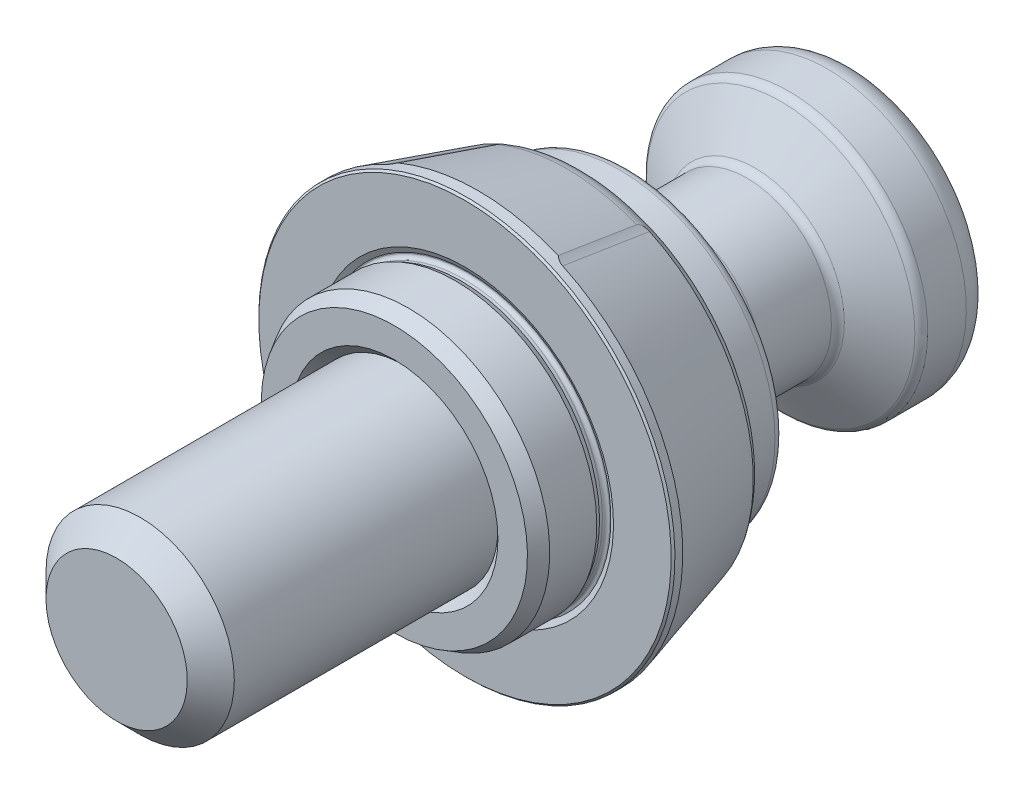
ISO-10303-21;
HEADER;
FILE_DESCRIPTION(('STEP AP214'),'2;1');
FILE_NAME('part.step','',(''),(''),'','','');
FILE_SCHEMA(('AUTOMOTIVE_DESIGN { 1 0 10303 214 1 1 1 1 }'));
ENDSEC;
DATA;
#1=APPLICATION_CONTEXT('core data for automotive mechanical design processes');
#2=APPLICATION_PROTOCOL_DEFINITION('international standard','automotive_design',2000,#1);
#3=PRODUCT_CONTEXT('',#1,'mechanical');
#4=PRODUCT('Part','Part','',(#3));
#5=PRODUCT_RELATED_PRODUCT_CATEGORY('part','',(#4));
#6=PRODUCT_DEFINITION_FORMATION('','',#4);
#7=PRODUCT_DEFINITION_CONTEXT('part definition',#1,'design');
#8=PRODUCT_DEFINITION('design','',#6,#7);
#9=PRODUCT_DEFINITION_SHAPE('','',#8);
#10=(LENGTH_UNIT() NAMED_UNIT(*) SI_UNIT(.MILLI.,.METRE.));
#11=(NAMED_UNIT(*) PLANE_ANGLE_UNIT() SI_UNIT($,.RADIAN.));
#12=(NAMED_UNIT(*) SI_UNIT($,.STERADIAN.) SOLID_ANGLE_UNIT());
#13=UNCERTAINTY_MEASURE_WITH_UNIT(LENGTH_MEASURE(1.E-05),#10,'distance_accuracy_value','');
#14=(GEOMETRIC_REPRESENTATION_CONTEXT(3) GLOBAL_UNCERTAINTY_ASSIGNED_CONTEXT((#13)) GLOBAL_UNIT_ASSIGNED_CONTEXT((#10,
#11,#12)) REPRESENTATION_CONTEXT('',''));
#15=CARTESIAN_POINT('',(0.,0.,0.));
#16=DIRECTION('',(0.,0.,1.));
#17=DIRECTION('',(1.,0.,0.));
#18=AXIS2_PLACEMENT_3D('',#15,#16,#17);
#19=CARTESIAN_POINT('',(15.1,0.,-0.3));
#20=DIRECTION('',(0.,0.,-1.));
#21=DIRECTION('',(0.,1.,0.));
#22=AXIS2_PLACEMENT_3D('',#19,#20,#21);
#23=PLANE('',#22);
#24=CARTESIAN_POINT('',(0.,0.,-0.3));
#25=DIRECTION('',(0.,0.,-1.));
#26=DIRECTION('',(0.,1.,0.));
#27=AXIS2_PLACEMENT_3D('',#24,#25,#26);
#28=CIRCLE('',#27,15.1978793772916);
#29=CARTESIAN_POINT('',(0.,15.1978793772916,-0.3));
#30=VERTEX_POINT('',#29);
#31=EDGE_CURVE('E592',#30,#30,#28,.T.);
#32=ORIENTED_EDGE('',*,*,#31,.F.);
#33=EDGE_LOOP('',(#32));
#34=FACE_BOUND('',#33,.T.);
#35=CARTESIAN_POINT('',(0.,0.,-0.3));
#36=DIRECTION('',(0.,0.,-1.));
#37=DIRECTION('',(0.,1.,0.));
#38=AXIS2_PLACEMENT_3D('',#35,#36,#37);
#39=CIRCLE('',#38,15.1);
#40=CARTESIAN_POINT('',(0.,15.1,-0.3));
#41=VERTEX_POINT('',#40);
#42=EDGE_CURVE('E587',#41,#41,#39,.T.);
#43=ORIENTED_EDGE('',*,*,#42,.T.);
#44=EDGE_LOOP('',(#43));
#45=FACE_BOUND('',#44,.T.);
#46=ADVANCED_FACE('F14',(#34,#45),#23,.F.);
#47=CARTESIAN_POINT('',(0.,0.,0.1));
#48=DIRECTION('',(0.,0.,-1.));
#49=DIRECTION('',(0.,1.,0.));
#50=AXIS2_PLACEMENT_3D('',#47,#48,#49);
#51=TOROIDAL_SURFACE('',#50,15.1,0.4);
#52=ORIENTED_EDGE('',*,*,#42,.F.);
#53=EDGE_LOOP('',(#52));
#54=FACE_BOUND('',#53,.T.);
#55=CARTESIAN_POINT('',(0.,0.,0.1));
#56=DIRECTION('',(0.,0.,-1.));
#57=DIRECTION('',(0.,1.,0.));
#58=AXIS2_PLACEMENT_3D('',#55,#56,#57);
#59=CIRCLE('',#58,14.7);
#60=CARTESIAN_POINT('',(0.,14.7,0.1));
#61=VERTEX_POINT('',#60);
#62=EDGE_CURVE('E583',#61,#61,#59,.T.);
#63=ORIENTED_EDGE('',*,*,#62,.T.);
#64=EDGE_LOOP('',(#63));
#65=FACE_BOUND('',#64,.T.);
#66=ADVANCED_FACE('F870',(#54,#65),#51,.F.);
#67=CARTESIAN_POINT('',(0.,0.,0.));
#68=DIRECTION('',(0.,0.,-1.));
#69=DIRECTION('',(0.,1.,0.));
#70=AXIS2_PLACEMENT_3D('',#67,#68,#69);
#71=CYLINDRICAL_SURFACE('',#70,14.7);
#72=ORIENTED_EDGE('',*,*,#62,.F.);
#73=EDGE_LOOP('',(#72));
#74=FACE_BOUND('',#73,.T.);
#75=CARTESIAN_POINT('',(0.,0.,0.411216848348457));
#76=DIRECTION('',(0.,0.,-1.));
#77=DIRECTION('',(0.,1.,0.));
#78=AXIS2_PLACEMENT_3D('',#75,#76,#77);
#79=CIRCLE('',#78,14.7);
#80=CARTESIAN_POINT('',(0.,14.7,0.411216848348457));
#81=VERTEX_POINT('',#80);
#82=EDGE_CURVE('E581',#81,#81,#79,.T.);
#83=ORIENTED_EDGE('',*,*,#82,.T.);
#84=EDGE_LOOP('',(#83));
#85=FACE_BOUND('',#84,.T.);
#86=ADVANCED_FACE('F575',(#74,#85),#71,.T.);
#87=CARTESIAN_POINT('',(0.,0.,1.));
#88=DIRECTION('',(0.,0.,1.));
#89=DIRECTION('',(0.,-1.,0.));
#90=AXIS2_PLACEMENT_3D('',#87,#88,#89);
#91=CONICAL_SURFACE('',#90,15.,0.471238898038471);
#92=ORIENTED_EDGE('',*,*,#82,.F.);
#93=EDGE_LOOP('',(#92));
#94=FACE_BOUND('',#93,.T.);
#95=CARTESIAN_POINT('',(0.,0.,1.));
#96=DIRECTION('',(0.,0.,-1.));
#97=DIRECTION('',(0.,1.,0.));
#98=AXIS2_PLACEMENT_3D('',#95,#96,#97);
#99=CIRCLE('',#98,15.);
#100=CARTESIAN_POINT('',(0.,15.,1.));
#101=VERTEX_POINT('',#100);
#102=EDGE_CURVE('E144',#101,#101,#99,.T.);
#103=ORIENTED_EDGE('',*,*,#102,.T.);
#104=EDGE_LOOP('',(#103));
#105=FACE_BOUND('',#104,.T.);
#106=ADVANCED_FACE('F569',(#94,#105),#91,.T.);
#107=CARTESIAN_POINT('',(0.,0.,0.));
#108=DIRECTION('',(0.,0.,-1.));
#109=DIRECTION('',(0.,1.,0.));
#110=AXIS2_PLACEMENT_3D('',#107,#108,#109);
#111=CYLINDRICAL_SURFACE('',#110,15.);
#112=ORIENTED_EDGE('',*,*,#102,.F.);
#113=EDGE_LOOP('',(#112));
#114=FACE_BOUND('',#113,.T.);
#115=CARTESIAN_POINT('',(0.,0.,6.));
#116=DIRECTION('',(0.,0.,1.));
#117=DIRECTION('',(0.,-1.,0.));
#118=AXIS2_PLACEMENT_3D('',#115,#116,#117);
#119=CIRCLE('',#118,15.);
#120=CARTESIAN_POINT('',(0.,-15.,6.));
#121=VERTEX_POINT('',#120);
#122=EDGE_CURVE('E295',#121,#121,#119,.F.);
#123=ORIENTED_EDGE('',*,*,#122,.T.);
#124=EDGE_LOOP('',(#123));
#125=FACE_BOUND('',#124,.T.);
#126=ADVANCED_FACE('F208',(#114,#125),#111,.T.);
#127=CARTESIAN_POINT('',(0.,0.,6.));
#128=DIRECTION('',(0.,0.,-1.));
#129=DIRECTION('',(0.,1.,0.));
#130=AXIS2_PLACEMENT_3D('',#127,#128,#129);
#131=CONICAL_SURFACE('',#130,15.,0.523598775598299);
#132=CARTESIAN_POINT('',(0.,0.,7.5));
#133=DIRECTION('',(0.,0.,1.));
#134=DIRECTION('',(0.,-1.,0.));
#135=AXIS2_PLACEMENT_3D('',#132,#133,#134);
#136=CIRCLE('',#135,14.1339745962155);
#137=CARTESIAN_POINT('',(0.,-14.1339745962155,7.5));
#138=VERTEX_POINT('',#137);
#139=EDGE_CURVE('E298',#138,#138,#136,.T.);
#140=ORIENTED_EDGE('',*,*,#139,.F.);
#141=EDGE_LOOP('',(#140));
#142=FACE_BOUND('',#141,.T.);
#143=ORIENTED_EDGE('',*,*,#122,.F.);
#144=EDGE_LOOP('',(#143));
#145=FACE_BOUND('',#144,.T.);
#146=ADVANCED_FACE('F209',(#142,#145),#131,.T.);
#147=CARTESIAN_POINT('',(10.,0.,7.5));
#148=DIRECTION('',(0.,0.,1.));
#149=DIRECTION('',(0.,-1.,0.));
#150=AXIS2_PLACEMENT_3D('',#147,#148,#149);
#151=PLANE('',#150);
#152=CARTESIAN_POINT('',(0.,0.,7.5));
#153=DIRECTION('',(0.,0.,1.));
#154=DIRECTION('',(0.,-1.,0.));
#155=AXIS2_PLACEMENT_3D('',#152,#153,#154);
#156=CIRCLE('',#155,11.);
#157=CARTESIAN_POINT('',(0.,-11.,7.5));
#158=VERTEX_POINT('',#157);
#159=EDGE_CURVE('E301',#158,#158,#156,.F.);
#160=ORIENTED_EDGE('',*,*,#159,.T.);
#161=EDGE_LOOP('',(#160));
#162=FACE_BOUND('',#161,.T.);
#163=ORIENTED_EDGE('',*,*,#139,.T.);
#164=EDGE_LOOP('',(#163));
#165=FACE_BOUND('',#164,.T.);
#166=ADVANCED_FACE('F557',(#162,#165),#151,.T.);
#167=CARTESIAN_POINT('',(0.,0.,7.5));
#168=DIRECTION('',(0.,0.,1.));
#169=DIRECTION('',(0.,-1.,0.));
#170=AXIS2_PLACEMENT_3D('',#167,#168,#169);
#171=CONICAL_SURFACE('',#170,11.,0.785398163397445);
#172=CARTESIAN_POINT('',(0.,0.,6.5));
#173=DIRECTION('',(0.,0.,1.));
#174=DIRECTION('',(0.,-1.,0.));
#175=AXIS2_PLACEMENT_3D('',#172,#173,#174);
#176=CIRCLE('',#175,10.);
#177=CARTESIAN_POINT('',(0.,-10.,6.5));
#178=VERTEX_POINT('',#177);
#179=EDGE_CURVE('E304',#178,#178,#176,.T.);
#180=ORIENTED_EDGE('',*,*,#179,.F.);
#181=EDGE_LOOP('',(#180));
#182=FACE_BOUND('',#181,.T.);
#183=ORIENTED_EDGE('',*,*,#159,.F.);
#184=EDGE_LOOP('',(#183));
#185=FACE_BOUND('',#184,.T.);
#186=ADVANCED_FACE('F553',(#182,#185),#171,.F.);
#187=CARTESIAN_POINT('',(0.,0.,-0.3));
#188=DIRECTION('',(0.,0.,1.));
#189=DIRECTION('',(0.,-1.,0.));
#190=AXIS2_PLACEMENT_3D('',#187,#188,#189);
#191=CONICAL_SURFACE('',#190,15.1978793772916,1.09083078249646);
#192=CARTESIAN_POINT('',(0.,0.,0.));
#193=DIRECTION('',(0.,0.,-1.));
#194=DIRECTION('',(0.,1.,0.));
#195=AXIS2_PLACEMENT_3D('',#192,#193,#194);
#196=CIRCLE('',#195,15.774174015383);
#197=CARTESIAN_POINT('',(0.,15.774174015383,0.));
#198=VERTEX_POINT('',#197);
#199=EDGE_CURVE('E595',#198,#198,#196,.T.);
#200=ORIENTED_EDGE('',*,*,#199,.F.);
#201=EDGE_LOOP('',(#200));
#202=FACE_BOUND('',#201,.T.);
#203=ORIENTED_EDGE('',*,*,#31,.T.);
#204=EDGE_LOOP('',(#203));
#205=FACE_BOUND('',#204,.T.);
#206=ADVANCED_FACE('F556',(#202,#205),#191,.F.);
#207=CARTESIAN_POINT('',(15.,0.,0.));
#208=DIRECTION('',(0.,0.,1.));
#209=DIRECTION('',(0.,-1.,0.));
#210=AXIS2_PLACEMENT_3D('',#207,#208,#209);
#211=PLANE('',#210);
#212=ORIENTED_EDGE('',*,*,#199,.T.);
#213=EDGE_LOOP('',(#212));
#214=FACE_BOUND('',#213,.T.);
#215=CARTESIAN_POINT('',(0.,0.,0.));
#216=DIRECTION('',(0.,0.,1.));
#217=DIRECTION('',(0.,-1.,0.));
#218=AXIS2_PLACEMENT_3D('',#215,#216,#217);
#219=CIRCLE('',#218,21.9);
#220=CARTESIAN_POINT('',(0.,-21.9,0.));
#221=VERTEX_POINT('',#220);
#222=EDGE_CURVE('E310',#221,#221,#219,.T.);
#223=ORIENTED_EDGE('',*,*,#222,.T.);
#224=EDGE_LOOP('',(#223));
#225=FACE_BOUND('',#224,.T.);
#226=ADVANCED_FACE('F664',(#214,#225),#211,.T.);
#227=CARTESIAN_POINT('',(0.,0.,-0.199999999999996));
#228=DIRECTION('',(0.,0.,-1.));
#229=DIRECTION('',(0.,1.,0.));
#230=AXIS2_PLACEMENT_3D('',#227,#228,#229);
#231=CONICAL_SURFACE('',#230,22.1,0.785398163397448);
#232=ORIENTED_EDGE('',*,*,#222,.F.);
#233=EDGE_LOOP('',(#232));
#234=FACE_BOUND('',#233,.T.);
#235=CARTESIAN_POINT('',(0.,0.,-0.199999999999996));
#236=DIRECTION('',(0.,0.,1.));
#237=DIRECTION('',(0.,-1.,0.));
#238=AXIS2_PLACEMENT_3D('',#235,#236,#237);
#239=CIRCLE('',#238,22.1);
#240=CARTESIAN_POINT('',(0.,-22.1,-0.199999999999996));
#241=VERTEX_POINT('',#240);
#242=EDGE_CURVE('E307',#241,#241,#239,.F.);
#243=ORIENTED_EDGE('',*,*,#242,.F.);
#244=EDGE_LOOP('',(#243));
#245=FACE_BOUND('',#244,.T.);
#246=ADVANCED_FACE('F342',(#234,#245),#231,.T.);
#247=CARTESIAN_POINT('',(0.,0.,0.));
#248=DIRECTION('',(0.,0.,-1.));
#249=DIRECTION('',(0.,1.,0.));
#250=AXIS2_PLACEMENT_3D('',#247,#248,#249);
#251=CYLINDRICAL_SURFACE('',#250,22.1);
#252=ORIENTED_EDGE('',*,*,#242,.T.);
#253=EDGE_LOOP('',(#252));
#254=FACE_BOUND('',#253,.T.);
#255=CARTESIAN_POINT('',(0.,0.,-1.03217024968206));
#256=DIRECTION('',(0.,0.,1.));
#257=DIRECTION('',(0.,-1.,0.));
#258=AXIS2_PLACEMENT_3D('',#255,#256,#257);
#259=CIRCLE('',#258,22.1);
#260=CARTESIAN_POINT('',(-9.3398635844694,20.02940209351,-1.03217024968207));
#261=VERTEX_POINT('',#260);
#262=CARTESIAN_POINT('',(-9.3398635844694,-20.02940209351,-1.03217024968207));
#263=VERTEX_POINT('',#262);
#264=EDGE_CURVE('E159',#261,#263,#259,.T.);
#265=ORIENTED_EDGE('',*,*,#264,.T.);
#266=CARTESIAN_POINT('',(-10.1506280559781,-19.6309640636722,-1.39496577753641));
#267=CARTESIAN_POINT('',(-10.097135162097,-19.6586212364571,-1.34633121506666));
#268=CARTESIAN_POINT('',(-10.0411826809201,-19.6872777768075,-1.30047984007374));
#269=CARTESIAN_POINT('',(-9.92349290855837,-19.7468664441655,-1.21648741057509));
#270=CARTESIAN_POINT('',(-9.86168347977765,-19.7778255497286,-1.17846784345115));
#271=CARTESIAN_POINT('',(-9.73243072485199,-19.8417490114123,-1.11358922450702));
#272=CARTESIAN_POINT('',(-9.66494496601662,-19.8747278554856,-1.08682524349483));
#273=CARTESIAN_POINT('',(-9.52658153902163,-19.9414159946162,-1.04841254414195));
#274=CARTESIAN_POINT('',(-9.45573000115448,-19.9751188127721,-1.03666246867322));
#275=CARTESIAN_POINT('',(-9.32058549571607,-20.0385044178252,-1.03017430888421));
#276=CARTESIAN_POINT('',(-9.25639363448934,-20.0682345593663,-1.0337645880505));
#277=CARTESIAN_POINT('',(-9.12928394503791,-20.1263777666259,-1.05374959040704));
#278=CARTESIAN_POINT('',(-9.06636988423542,-20.1547871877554,-1.07017774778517));
#279=CARTESIAN_POINT('',(-8.93009267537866,-20.2155925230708,-1.11879338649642));
#280=CARTESIAN_POINT('',(-8.8574800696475,-20.2474883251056,-1.15365492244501));
#281=CARTESIAN_POINT('',(-8.71800848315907,-20.307933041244,-1.23537421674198));
#282=CARTESIAN_POINT('',(-8.65115371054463,-20.3364795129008,-1.28224065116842));
#283=CARTESIAN_POINT('',(-8.5621500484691,-20.3740106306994,-1.35327733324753));
#284=CARTESIAN_POINT('',(-8.53760965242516,-20.3843048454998,-1.37385098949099));
#285=CARTESIAN_POINT('',(-8.51349298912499,-20.3943726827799,-1.39496577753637));
#286=B_SPLINE_CURVE_WITH_KNOTS('',3,(#266,#267,#268,#269,#270,#271,#272,#273,#274,#275,#276,
#277,#278,#279,#280,#281,#282,#283,#284,#285),.UNSPECIFIED.,.F.,.F.,(4,2,2,2,2,2,2,2,2,4),(0.,
0.232597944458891,0.468569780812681,0.706496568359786,0.942808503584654,1.15406503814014,
1.36587359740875,1.62433285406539,1.8829794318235,1.98383460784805),.UNSPECIFIED.);
#287=CARTESIAN_POINT('',(-8.51349298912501,-20.3943726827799,-1.39496577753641));
#288=VERTEX_POINT('',#287);
#289=EDGE_CURVE('E284',#263,#288,#286,.T.);
#290=ORIENTED_EDGE('',*,*,#289,.T.);
#291=CARTESIAN_POINT('',(0.,0.,-1.3949657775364));
#292=DIRECTION('',(0.,0.,-1.));
#293=DIRECTION('',(0.,1.,0.));
#294=AXIS2_PLACEMENT_3D('',#291,#292,#293);
#295=CIRCLE('',#294,22.1);
#296=CARTESIAN_POINT('',(8.51349298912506,-20.3943726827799,-1.39496577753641));
#297=VERTEX_POINT('',#296);
#298=EDGE_CURVE('E143',#297,#288,#295,.T.);
#299=ORIENTED_EDGE('',*,*,#298,.F.);
#300=CARTESIAN_POINT('',(8.51349298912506,-20.3943726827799,-1.39496577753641));
#301=CARTESIAN_POINT('',(8.56906418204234,-20.371172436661,-1.3463312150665));
#302=CARTESIAN_POINT('',(8.62698192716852,-20.3467304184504,-1.30047984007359));
#303=CARTESIAN_POINT('',(8.74827902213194,-20.2948776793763,-1.21648741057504));
#304=CARTESIAN_POINT('',(8.81172540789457,-20.2674290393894,-1.17846784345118));
#305=CARTESIAN_POINT('',(8.94377568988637,-20.2095048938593,-1.113589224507));
#306=CARTESIAN_POINT('',(9.01241795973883,-20.1790061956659,-1.08682524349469));
#307=CARTESIAN_POINT('',(9.15244233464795,-20.1158799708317,-1.04841254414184));
#308=CARTESIAN_POINT('',(9.223802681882,-20.0832682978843,-1.03666246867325));
#309=CARTESIAN_POINT('',(9.3592280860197,-20.0204850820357,-1.03017430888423));
#310=CARTESIAN_POINT('',(9.42326442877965,-19.9904214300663,-1.03376458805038));
#311=CARTESIAN_POINT('',(9.54950924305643,-19.9304234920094,-1.05374959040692));
#312=CARTESIAN_POINT('',(9.61171250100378,-19.900489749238,-1.07017774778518));
#313=CARTESIAN_POINT('',(9.74588939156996,-19.8351802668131,-1.11879338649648));
#314=CARTESIAN_POINT('',(9.81699747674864,-19.8000580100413,-1.15365492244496));
#315=CARTESIAN_POINT('',(9.95295142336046,-19.7320696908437,-1.2353742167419));
#316=CARTESIAN_POINT('',(10.0177927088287,-19.6992052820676,-1.28224065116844));
#317=CARTESIAN_POINT('',(10.1037536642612,-19.6551490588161,-1.35327733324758));
#318=CARTESIAN_POINT('',(10.1274137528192,-19.6429670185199,-1.37385098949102));
#319=CARTESIAN_POINT('',(10.1506280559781,-19.6309640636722,-1.39496577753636));
#320=B_SPLINE_CURVE_WITH_KNOTS('',3,(#300,#301,#302,#303,#304,#305,#306,#307,#308,#309,#310,
#311,#312,#313,#314,#315,#316,#317,#318,#319),.UNSPECIFIED.,.F.,.F.,(4,2,2,2,2,2,2,2,2,4),(0.,
0.232597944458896,0.468569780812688,0.706496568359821,0.942808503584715,1.1540650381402,
1.36587359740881,1.62433285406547,1.8829794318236,1.98383460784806),.UNSPECIFIED.);
#321=CARTESIAN_POINT('',(9.3398635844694,-20.02940209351,-1.03217024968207));
#322=VERTEX_POINT('',#321);
#323=EDGE_CURVE('E231',#297,#322,#320,.T.);
#324=ORIENTED_EDGE('',*,*,#323,.T.);
#325=CARTESIAN_POINT('',(0.,0.,-1.03217024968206));
#326=DIRECTION('',(0.,0.,1.));
#327=DIRECTION('',(0.,-1.,0.));
#328=AXIS2_PLACEMENT_3D('',#325,#326,#327);
#329=CIRCLE('',#328,22.1);
#330=CARTESIAN_POINT('',(9.3398635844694,20.02940209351,-1.03217024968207));
#331=VERTEX_POINT('',#330);
#332=EDGE_CURVE('E155',#331,#322,#329,.F.);
#333=ORIENTED_EDGE('',*,*,#332,.F.);
#334=CARTESIAN_POINT('',(10.1506280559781,19.6309640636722,-1.39496577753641));
#335=CARTESIAN_POINT('',(10.097135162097,19.6586212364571,-1.34633121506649));
#336=CARTESIAN_POINT('',(10.0411826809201,19.6872777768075,-1.30047984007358));
#337=CARTESIAN_POINT('',(9.92349290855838,19.7468664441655,-1.21648741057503));
#338=CARTESIAN_POINT('',(9.86168347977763,19.7778255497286,-1.17846784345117));
#339=CARTESIAN_POINT('',(9.73243072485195,19.8417490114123,-1.113589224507));
#340=CARTESIAN_POINT('',(9.6649449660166,19.8747278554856,-1.08682524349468));
#341=CARTESIAN_POINT('',(9.52658153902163,19.9414159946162,-1.04841254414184));
#342=CARTESIAN_POINT('',(9.45573000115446,19.9751188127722,-1.03666246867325));
#343=CARTESIAN_POINT('',(9.32058549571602,20.0385044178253,-1.03017430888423));
#344=CARTESIAN_POINT('',(9.25639363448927,20.0682345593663,-1.03376458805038));
#345=CARTESIAN_POINT('',(9.12928394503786,20.1263777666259,-1.05374959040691));
#346=CARTESIAN_POINT('',(9.0663698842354,20.1547871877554,-1.07017774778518));
#347=CARTESIAN_POINT('',(8.93009267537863,20.2155925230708,-1.11879338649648));
#348=CARTESIAN_POINT('',(8.85748006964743,20.2474883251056,-1.15365492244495));
#349=CARTESIAN_POINT('',(8.71800848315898,20.3079330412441,-1.2353742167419));
#350=CARTESIAN_POINT('',(8.65115371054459,20.3364795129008,-1.28224065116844));
#351=CARTESIAN_POINT('',(8.5621500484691,20.3740106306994,-1.35327733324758));
#352=CARTESIAN_POINT('',(8.53760965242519,20.3843048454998,-1.37385098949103));
#353=CARTESIAN_POINT('',(8.51349298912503,20.3943726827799,-1.39496577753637));
#354=B_SPLINE_CURVE_WITH_KNOTS('',3,(#334,#335,#336,#337,#338,#339,#340,#341,#342,#343,#344,
#345,#346,#347,#348,#349,#350,#351,#352,#353),.UNSPECIFIED.,.F.,.F.,(4,2,2,2,2,2,2,2,2,4),(0.,
0.232597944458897,0.468569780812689,0.70649656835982,0.942808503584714,1.1540650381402,
1.3658735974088,1.62433285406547,1.8829794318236,1.98383460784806),.UNSPECIFIED.);
#355=CARTESIAN_POINT('',(8.51349298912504,20.3943726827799,-1.3949657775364));
#356=VERTEX_POINT('',#355);
#357=EDGE_CURVE('E39',#331,#356,#354,.T.);
#358=ORIENTED_EDGE('',*,*,#357,.T.);
#359=CARTESIAN_POINT('',(-8.51349298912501,20.3943726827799,-1.3949657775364));
#360=VERTEX_POINT('',#359);
#361=EDGE_CURVE('E135',#360,#356,#295,.T.);
#362=ORIENTED_EDGE('',*,*,#361,.F.);
#363=CARTESIAN_POINT('',(-8.51349298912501,20.3943726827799,-1.39496577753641));
#364=CARTESIAN_POINT('',(-8.56906418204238,20.371172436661,-1.34633121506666));
#365=CARTESIAN_POINT('',(-8.62698192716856,20.3467304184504,-1.30047984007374));
#366=CARTESIAN_POINT('',(-8.74827902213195,20.2948776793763,-1.2164874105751));
#367=CARTESIAN_POINT('',(-8.81172540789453,20.2674290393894,-1.17846784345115));
#368=CARTESIAN_POINT('',(-8.94377568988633,20.2095048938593,-1.11358922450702));
#369=CARTESIAN_POINT('',(-9.01241795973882,20.1790061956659,-1.08682524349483));
#370=CARTESIAN_POINT('',(-9.15244233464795,20.1158799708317,-1.04841254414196));
#371=CARTESIAN_POINT('',(-9.22380268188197,20.0832682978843,-1.03666246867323));
#372=CARTESIAN_POINT('',(-9.35922808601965,20.0204850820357,-1.03017430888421));
#373=CARTESIAN_POINT('',(-9.4232644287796,19.9904214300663,-1.03376458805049));
#374=CARTESIAN_POINT('',(-9.5495092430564,19.9304234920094,-1.05374959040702));
#375=CARTESIAN_POINT('',(-9.61171250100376,19.900489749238,-1.07017774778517));
#376=CARTESIAN_POINT('',(-9.74588939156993,19.8351802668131,-1.11879338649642));
#377=CARTESIAN_POINT('',(-9.81699747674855,19.8000580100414,-1.15365492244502));
#378=CARTESIAN_POINT('',(-9.95295142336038,19.7320696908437,-1.23537421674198));
#379=CARTESIAN_POINT('',(-10.0177927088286,19.6992052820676,-1.28224065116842));
#380=CARTESIAN_POINT('',(-10.1037536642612,19.6551490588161,-1.35327733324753));
#381=CARTESIAN_POINT('',(-10.1274137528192,19.6429670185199,-1.373850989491));
#382=CARTESIAN_POINT('',(-10.1506280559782,19.6309640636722,-1.39496577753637));
#383=B_SPLINE_CURVE_WITH_KNOTS('',3,(#363,#364,#365,#366,#367,#368,#369,#370,#371,#372,#373,
#374,#375,#376,#377,#378,#379,#380,#381,#382),.UNSPECIFIED.,.F.,.F.,(4,2,2,2,2,2,2,2,2,4),(0.,
0.232597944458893,0.468569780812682,0.706496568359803,0.942808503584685,1.15406503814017,
1.36587359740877,1.6243328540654,1.88297943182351,1.98383460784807),.UNSPECIFIED.);
#384=EDGE_CURVE('E194',#360,#261,#383,.T.);
#385=ORIENTED_EDGE('',*,*,#384,.T.);
#386=EDGE_LOOP('',(#265,#290,#299,#324,#333,#358,#362,#385));
#387=FACE_BOUND('',#386,.T.);
#388=ADVANCED_FACE('F152',(#254,#387),#251,.T.);
#389=CARTESIAN_POINT('',(9.38757893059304,-20.1317279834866,-18.7782031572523));
#390=DIRECTION('',(-0.116489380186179,0.249812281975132,-0.961261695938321));
#391=DIRECTION('',(0.,-0.967850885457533,-0.251524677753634));
#392=AXIS2_PLACEMENT_3D('',#389,#390,#391);
#393=CYLINDRICAL_SURFACE('',#392,5.);
#394=CARTESIAN_POINT('',(8.99688867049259,-17.1825794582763,-10.826712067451));
#395=CARTESIAN_POINT('',(8.99191793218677,-17.1718191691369,-10.8681473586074));
#396=CARTESIAN_POINT('',(8.98274621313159,-17.1621721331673,-10.9092972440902));
#397=CARTESIAN_POINT('',(8.95686401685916,-17.1454999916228,-10.9894585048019));
#398=CARTESIAN_POINT('',(8.94019625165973,-17.1384604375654,-11.0284806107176));
#399=CARTESIAN_POINT('',(8.90012730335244,-17.1272743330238,-11.1032850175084));
#400=CARTESIAN_POINT('',(8.87673151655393,-17.1231254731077,-11.13906988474));
#401=CARTESIAN_POINT('',(8.8243754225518,-17.1179169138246,-11.2065689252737));
#402=CARTESIAN_POINT('',(8.7954109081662,-17.1168595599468,-11.2382799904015));
#403=CARTESIAN_POINT('',(8.7346047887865,-17.117904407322,-11.2957275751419));
#404=CARTESIAN_POINT('',(8.70295299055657,-17.1198656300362,-11.3216696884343));
#405=CARTESIAN_POINT('',(8.63679277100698,-17.1266732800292,-11.3691284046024));
#406=CARTESIAN_POINT('',(8.60228396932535,-17.1315200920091,-11.3906444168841));
#407=CARTESIAN_POINT('',(8.52631058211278,-17.1449105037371,-11.4319505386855));
#408=CARTESIAN_POINT('',(8.48455350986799,-17.1538808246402,-11.4510633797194));
#409=CARTESIAN_POINT('',(8.3997253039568,-17.1752964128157,-11.4835576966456));
#410=CARTESIAN_POINT('',(8.35665340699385,-17.1877437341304,-11.4969357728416));
#411=CARTESIAN_POINT('',(8.26396621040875,-17.2179054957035,-11.5196052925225));
#412=CARTESIAN_POINT('',(8.21430104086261,-17.2361200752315,-11.5280318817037));
#413=CARTESIAN_POINT('',(8.11581605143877,-17.2763718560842,-11.5376846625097));
#414=CARTESIAN_POINT('',(8.06699673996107,-17.298411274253,-11.5389066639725));
#415=CARTESIAN_POINT('',(7.9669236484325,-17.3480007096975,-11.5339457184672));
#416=CARTESIAN_POINT('',(7.91586074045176,-17.3758715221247,-11.5270692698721));
#417=CARTESIAN_POINT('',(7.81755166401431,-17.4347503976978,-11.5045863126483));
#418=CARTESIAN_POINT('',(7.77030714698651,-17.4657598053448,-11.4889760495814));
#419=CARTESIAN_POINT('',(7.68205023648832,-17.529182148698,-11.4491378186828));
#420=CARTESIAN_POINT('',(7.64094073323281,-17.5615596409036,-11.425070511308));
#421=CARTESIAN_POINT('',(7.565725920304,-17.6266827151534,-11.3681395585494));
#422=CARTESIAN_POINT('',(7.53160621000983,-17.6594273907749,-11.3352943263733));
#423=CARTESIAN_POINT('',(7.48033392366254,-17.7145327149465,-11.2713027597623));
#424=CARTESIAN_POINT('',(7.46109336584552,-17.7372826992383,-11.2421515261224));
#425=CARTESIAN_POINT('',(7.427951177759,-17.7810273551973,-11.1797473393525));
#426=CARTESIAN_POINT('',(7.41404827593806,-17.8020224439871,-11.1464953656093));
#427=CARTESIAN_POINT('',(7.39213552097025,-17.8414024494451,-11.0764013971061));
#428=CARTESIAN_POINT('',(7.38415734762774,-17.8597729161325,-11.0395412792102));
#429=CARTESIAN_POINT('',(7.37464770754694,-17.8928365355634,-10.9634757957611));
#430=CARTESIAN_POINT('',(7.37310260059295,-17.9075374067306,-10.9242755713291));
#431=CARTESIAN_POINT('',(7.37561579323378,-17.9261647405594,-10.8653787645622));
#432=CARTESIAN_POINT('',(7.37719262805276,-17.9317349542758,-10.8460634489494));
#433=CARTESIAN_POINT('',(7.37953094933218,-17.9367657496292,-10.8267120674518));
#434=B_SPLINE_CURVE_WITH_KNOTS('',3,(#394,#395,#396,#397,#398,#399,#400,#401,#402,#403,#404,
#405,#406,#407,#408,#409,#410,#411,#412,#413,#414,#415,#416,#417,#418,#419,#420,#421,#422,#423,
#424,#425,#426,#427,#428,#429,#430,#431,#432,#433),.UNSPECIFIED.,.F.,.F.,(4,2,2,2,2,2,2,2,2,2,2,
2,2,2,2,2,2,2,2,4),(0.,0.128987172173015,0.257248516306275,0.385407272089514,0.513663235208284,
0.636108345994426,0.758569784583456,0.89839481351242,1.03830261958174,1.19833902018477,
1.35846848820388,1.53336981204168,1.7083463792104,1.88016414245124,2.05162427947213,
2.17616001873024,2.30066607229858,2.425833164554,2.55073472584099,2.61114030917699),.UNSPECIFIED.);
#435=CARTESIAN_POINT('',(8.06676228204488,-17.2992275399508,-11.5377074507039));
#436=VERTEX_POINT('',#435);
#437=CARTESIAN_POINT('',(7.37950690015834,-17.9367136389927,-10.826912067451));
#438=VERTEX_POINT('',#437);
#439=EDGE_CURVE('E223',#436,#438,#434,.T.);
#440=ORIENTED_EDGE('',*,*,#439,.F.);
#441=DIRECTION('',(-0.116489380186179,0.249812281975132,-0.961261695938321));
#442=VECTOR('',#441,1.);
#443=CARTESIAN_POINT('',(7.88955606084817,-16.9192075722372,-13.));
#444=LINE('',#443,#442);
#445=EDGE_CURVE('E272',#322,#436,#444,.T.);
#446=ORIENTED_EDGE('',*,*,#445,.F.);
#447=ORIENTED_EDGE('',*,*,#323,.F.);
#448=CARTESIAN_POINT('',(7.37948287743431,-17.9366615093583,-10.827112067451));
#449=CARTESIAN_POINT('',(7.56831744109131,-18.3464058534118,-9.25506429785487));
#450=CARTESIAN_POINT('',(7.75723757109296,-18.7560916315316,-7.68301155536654));
#451=CARTESIAN_POINT('',(8.13524896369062,-19.5753460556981,-4.53889612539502));
#452=CARTESIAN_POINT('',(8.32434022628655,-19.9849147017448,-2.96683343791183));
#453=CARTESIAN_POINT('',(8.51351705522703,-20.3944247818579,-1.3947657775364));
#454=B_SPLINE_CURVE_WITH_KNOTS('',3,(#448,#449,#450,#451,#452,#453),.UNSPECIFIED.,.F.,.F.,(4,2,
4),(0.,4.90652093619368,9.81304186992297),.UNSPECIFIED.);
#455=EDGE_CURVE('E252',#438,#297,#454,.T.);
#456=ORIENTED_EDGE('',*,*,#455,.F.);
#457=EDGE_LOOP('',(#440,#446,#447,#456));
#458=FACE_BOUND('',#457,.T.);
#459=ADVANCED_FACE('F244',(#458),#393,.F.);
#460=CARTESIAN_POINT('',(0.,0.,0.));
#461=DIRECTION('',(0.,0.,1.));
#462=DIRECTION('',(0.,-1.,0.));
#463=AXIS2_PLACEMENT_3D('',#460,#461,#462);
#464=CONICAL_SURFACE('',#463,22.3959700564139,0.279252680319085);
#465=ORIENTED_EDGE('',*,*,#332,.T.);
#466=ORIENTED_EDGE('',*,*,#445,.T.);
#467=CARTESIAN_POINT('',(0.,0.,-11.5377074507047));
#468=DIRECTION('',(0.,0.,1.));
#469=DIRECTION('',(0.,-1.,0.));
#470=AXIS2_PLACEMENT_3D('',#467,#468,#469);
#471=CIRCLE('',#470,19.0875856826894);
#472=CARTESIAN_POINT('',(8.06676228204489,17.2992275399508,-11.5377074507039));
#473=VERTEX_POINT('',#472);
#474=EDGE_CURVE('E279',#436,#473,#471,.T.);
#475=ORIENTED_EDGE('',*,*,#474,.T.);
#476=DIRECTION('',(-0.116489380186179,-0.249812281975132,-0.961261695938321));
#477=VECTOR('',#476,1.);
#478=CARTESIAN_POINT('',(7.88955606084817,16.9192075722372,-13.));
#479=LINE('',#478,#477);
#480=EDGE_CURVE('E599',#331,#473,#479,.T.);
#481=ORIENTED_EDGE('',*,*,#480,.F.);
#482=EDGE_LOOP('',(#465,#466,#475,#481));
#483=FACE_BOUND('',#482,.T.);
#484=ADVANCED_FACE('F180',(#483),#464,.T.);
#485=CARTESIAN_POINT('',(9.38757893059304,20.1317279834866,-18.7782031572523));
#486=DIRECTION('',(-0.116489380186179,-0.249812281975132,-0.961261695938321));
#487=DIRECTION('',(0.,0.967850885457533,-0.251524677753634));
#488=AXIS2_PLACEMENT_3D('',#485,#486,#487);
#489=CYLINDRICAL_SURFACE('',#488,5.);
#490=ORIENTED_EDGE('',*,*,#480,.T.);
#491=CARTESIAN_POINT('',(7.37953094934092,17.9367657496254,-10.826712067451));
#492=CARTESIAN_POINT('',(7.37448321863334,17.9260413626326,-10.8681473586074));
#493=CARTESIAN_POINT('',(7.37298862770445,17.912814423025,-10.9092972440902));
#494=CARTESIAN_POINT('',(7.37685378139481,17.8822708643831,-10.9894585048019));
#495=CARTESIAN_POINT('',(7.38217500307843,17.8649776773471,-11.0284806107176));
#496=CARTESIAN_POINT('',(7.39936177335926,17.8270927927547,-11.1032850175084));
#497=CARTESIAN_POINT('',(7.41122208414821,17.8065037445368,-11.13906988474));
#498=CARTESIAN_POINT('',(7.44088594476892,17.7630486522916,-11.2065689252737));
#499=CARTESIAN_POINT('',(7.45869399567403,17.7401808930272,-11.2382799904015));
#500=CARTESIAN_POINT('',(7.49857981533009,17.6942723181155,-11.2957275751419));
#501=CARTESIAN_POINT('',(7.52042758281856,17.6712862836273,-11.3216696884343));
#502=CARTESIAN_POINT('',(7.56816951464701,17.6249804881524,-11.3691284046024));
#503=CARTESIAN_POINT('',(7.59406421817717,17.6016606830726,-11.3906444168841));
#504=CARTESIAN_POINT('',(7.6531566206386,17.5520688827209,-11.4319505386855));
#505=CARTESIAN_POINT('',(7.68686921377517,17.5258471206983,-11.4510633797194));
#506=CARTESIAN_POINT('',(7.75780102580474,17.4746306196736,-11.4835576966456));
#507=CARTESIAN_POINT('',(7.79502230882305,17.4496366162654,-11.4969357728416));
#508=CARTESIAN_POINT('',(7.87770574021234,17.3980217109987,-11.5196052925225));
#509=CARTESIAN_POINT('',(7.92358307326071,17.3716840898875,-11.5280318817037));
#510=CARTESIAN_POINT('',(8.01772265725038,17.3221135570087,-11.5376846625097));
#511=CARTESIAN_POINT('',(8.06598627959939,17.2988824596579,-11.5389066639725));
#512=CARTESIAN_POINT('',(8.16829973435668,17.2540974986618,-11.5339457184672));
#513=CARTESIAN_POINT('',(8.2224726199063,17.2328960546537,-11.5270692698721));
#514=CARTESIAN_POINT('',(8.33076831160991,17.1954335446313,-11.5045863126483));
#515=CARTESIAN_POINT('',(8.38489108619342,17.1791746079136,-11.4889760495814));
#516=CARTESIAN_POINT('',(8.49020586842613,17.1523329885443,-11.4491378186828));
#517=CARTESIAN_POINT('',(8.54143314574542,17.1416531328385,-11.425070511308));
#518=CARTESIAN_POINT('',(8.63966746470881,17.1258955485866,-11.3681395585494));
#519=CARTESIAN_POINT('',(8.68668306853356,17.1208062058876,-11.3352943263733));
#520=CARTESIAN_POINT('',(8.76185338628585,17.1169503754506,-11.2713027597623));
#521=CARTESIAN_POINT('',(8.79164847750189,17.1168346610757,-11.2421515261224));
#522=CARTESIAN_POINT('',(8.84646221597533,17.1195647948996,-11.1797473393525));
#523=CARTESIAN_POINT('',(8.87148200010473,17.1224099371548,-11.1464953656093));
#524=CARTESIAN_POINT('',(8.91573408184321,17.1309367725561,-11.0764013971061));
#525=CARTESIAN_POINT('',(8.9349349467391,17.1366334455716,-11.0395412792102));
#526=CARTESIAN_POINT('',(8.9663758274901,17.1506015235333,-10.9634757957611));
#527=CARTESIAN_POINT('',(8.97863052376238,17.158867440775,-10.9242755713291));
#528=CARTESIAN_POINT('',(8.99128444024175,17.1727660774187,-10.8653787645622));
#529=CARTESIAN_POINT('',(8.99453790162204,17.1775544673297,-10.8460634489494));
#530=CARTESIAN_POINT('',(8.99688867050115,17.182579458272,-10.8267120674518));
#531=B_SPLINE_CURVE_WITH_KNOTS('',3,(#491,#492,#493,#494,#495,#496,#497,#498,#499,#500,#501,
#502,#503,#504,#505,#506,#507,#508,#509,#510,#511,#512,#513,#514,#515,#516,#517,#518,#519,#520,
#521,#522,#523,#524,#525,#526,#527,#528,#529,#530),.UNSPECIFIED.,.F.,.F.,(4,2,2,2,2,2,2,2,2,2,2,
2,2,2,2,2,2,2,2,4),(0.,0.128987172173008,0.257248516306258,0.385407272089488,0.51366323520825,
0.636108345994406,0.758569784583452,0.898394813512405,1.03830261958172,1.19833902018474,
1.35846848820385,1.53336981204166,1.70834637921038,1.88016414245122,2.05162427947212,
2.17616001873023,2.30066607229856,2.42583316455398,2.55073472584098,2.61114030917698),.UNSPECIFIED.);
#532=CARTESIAN_POINT('',(7.37950690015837,17.9367136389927,-10.8269120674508));
#533=VERTEX_POINT('',#532);
#534=EDGE_CURVE('E148',#533,#473,#531,.T.);
#535=ORIENTED_EDGE('',*,*,#534,.F.);
#536=CARTESIAN_POINT('',(8.51351705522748,20.3944247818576,-1.3947657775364));
#537=CARTESIAN_POINT('',(8.24755369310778,19.818711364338,-3.60488608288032));
#538=CARTESIAN_POINT('',(7.98176343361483,19.2428795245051,-5.81499633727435));
#539=CARTESIAN_POINT('',(7.60389422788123,18.4235278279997,-8.95910351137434));
#540=CARTESIAN_POINT('',(7.49167309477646,18.1801052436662,-9.89310868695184));
#541=CARTESIAN_POINT('',(7.37948287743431,17.9366615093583,-10.827112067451));
#542=B_SPLINE_CURVE_WITH_KNOTS('',3,(#536,#537,#538,#539,#540,#541),.UNSPECIFIED.,.F.,.F.,(4,2,
4),(0.,6.89792193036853,9.81304186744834),.UNSPECIFIED.);
#543=EDGE_CURVE('E138',#356,#533,#542,.T.);
#544=ORIENTED_EDGE('',*,*,#543,.F.);
#545=ORIENTED_EDGE('',*,*,#357,.F.);
#546=EDGE_LOOP('',(#490,#535,#544,#545));
#547=FACE_BOUND('',#546,.T.);
#548=ADVANCED_FACE('F146',(#547),#489,.F.);
#549=CARTESIAN_POINT('',(0.,0.,-13.));
#550=DIRECTION('',(0.,0.,1.));
#551=DIRECTION('',(0.,-1.,0.));
#552=AXIS2_PLACEMENT_3D('',#549,#550,#551);
#553=CONICAL_SURFACE('',#552,18.7723099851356,0.279252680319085);
#554=CARTESIAN_POINT('',(0.,0.,-10.826912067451));
#555=DIRECTION('',(0.,0.,-1.));
#556=DIRECTION('',(0.,1.,0.));
#557=AXIS2_PLACEMENT_3D('',#554,#555,#556);
#558=CIRCLE('',#557,19.3954329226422);
#559=CARTESIAN_POINT('',(-7.37950690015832,17.9367136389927,-10.826912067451));
#560=VERTEX_POINT('',#559);
#561=EDGE_CURVE('E293',#533,#560,#558,.F.);
#562=ORIENTED_EDGE('',*,*,#561,.T.);
#563=CARTESIAN_POINT('',(-7.37948287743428,17.9366615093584,-10.827112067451));
#564=CARTESIAN_POINT('',(-7.56831744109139,18.3464058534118,-9.25506429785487));
#565=CARTESIAN_POINT('',(-7.75723757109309,18.7560916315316,-7.68301155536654));
#566=CARTESIAN_POINT('',(-8.13524896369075,19.575346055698,-4.53889612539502));
#567=CARTESIAN_POINT('',(-8.32434022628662,19.9849147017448,-2.96683343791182));
#568=CARTESIAN_POINT('',(-8.513517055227,20.3944247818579,-1.39476577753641));
#569=B_SPLINE_CURVE_WITH_KNOTS('',3,(#563,#564,#565,#566,#567,#568),.UNSPECIFIED.,.F.,.F.,(4,2,
4),(0.,4.90652093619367,9.81304186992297),.UNSPECIFIED.);
#570=EDGE_CURVE('E140',#560,#360,#569,.T.);
#571=ORIENTED_EDGE('',*,*,#570,.T.);
#572=ORIENTED_EDGE('',*,*,#361,.T.);
#573=ORIENTED_EDGE('',*,*,#543,.T.);
#574=EDGE_LOOP('',(#562,#571,#572,#573));
#575=FACE_BOUND('',#574,.T.);
#576=ADVANCED_FACE('F137',(#575),#553,.T.);
#577=CARTESIAN_POINT('',(-11.889459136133,25.4970273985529,1.86712610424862));
#578=DIRECTION('',(-0.116489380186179,0.249812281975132,0.961261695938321));
#579=DIRECTION('',(0.,-0.967850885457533,0.251524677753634));
#580=AXIS2_PLACEMENT_3D('',#577,#578,#579);
#581=CYLINDRICAL_SURFACE('',#580,5.);
#582=ORIENTED_EDGE('',*,*,#570,.F.);
#583=CARTESIAN_POINT('',(-8.99688867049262,17.1825794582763,-10.826712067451));
#584=CARTESIAN_POINT('',(-8.99191793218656,17.171819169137,-10.8681473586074));
#585=CARTESIAN_POINT('',(-8.98274621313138,17.1621721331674,-10.9092972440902));
#586=CARTESIAN_POINT('',(-8.95686401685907,17.1454999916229,-10.9894585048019));
#587=CARTESIAN_POINT('',(-8.94019625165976,17.1384604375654,-11.0284806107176));
#588=CARTESIAN_POINT('',(-8.90012730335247,17.1272743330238,-11.1032850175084));
#589=CARTESIAN_POINT('',(-8.87673151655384,17.1231254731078,-11.1390698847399));
#590=CARTESIAN_POINT('',(-8.82437542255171,17.1179169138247,-11.2065689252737));
#591=CARTESIAN_POINT('',(-8.79541090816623,17.1168595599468,-11.2382799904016));
#592=CARTESIAN_POINT('',(-8.73460478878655,17.117904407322,-11.2957275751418));
#593=CARTESIAN_POINT('',(-8.70295299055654,17.1198656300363,-11.3216696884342));
#594=CARTESIAN_POINT('',(-8.63679277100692,17.1266732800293,-11.3691284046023));
#595=CARTESIAN_POINT('',(-8.60228396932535,17.1315200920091,-11.3906444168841));
#596=CARTESIAN_POINT('',(-8.52631058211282,17.1449105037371,-11.4319505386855));
#597=CARTESIAN_POINT('',(-8.48455350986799,17.1538808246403,-11.4510633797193));
#598=CARTESIAN_POINT('',(-8.39972530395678,17.1752964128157,-11.4835576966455));
#599=CARTESIAN_POINT('',(-8.35665340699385,17.1877437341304,-11.4969357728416));
#600=CARTESIAN_POINT('',(-8.26396621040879,17.2179054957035,-11.5196052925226));
#601=CARTESIAN_POINT('',(-8.21430104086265,17.2361200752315,-11.5280318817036));
#602=CARTESIAN_POINT('',(-8.1158160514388,17.2763718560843,-11.5376846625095));
#603=CARTESIAN_POINT('',(-8.06699673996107,17.298411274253,-11.5389066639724));
#604=CARTESIAN_POINT('',(-7.96692364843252,17.3480007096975,-11.5339457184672));
#605=CARTESIAN_POINT('',(-7.91586074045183,17.3758715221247,-11.527069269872));
#606=CARTESIAN_POINT('',(-7.81755166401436,17.4347503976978,-11.5045863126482));
#607=CARTESIAN_POINT('',(-7.77030714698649,17.4657598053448,-11.4889760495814));
#608=CARTESIAN_POINT('',(-7.68205023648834,17.5291821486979,-11.4491378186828));
#609=CARTESIAN_POINT('',(-7.64094073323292,17.5615596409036,-11.4250705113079));
#610=CARTESIAN_POINT('',(-7.56572592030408,17.6266827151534,-11.3681395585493));
#611=CARTESIAN_POINT('',(-7.53160621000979,17.6594273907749,-11.3352943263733));
#612=CARTESIAN_POINT('',(-7.48033392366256,17.7145327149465,-11.2713027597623));
#613=CARTESIAN_POINT('',(-7.46109336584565,17.7372826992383,-11.2421515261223));
#614=CARTESIAN_POINT('',(-7.4279511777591,17.7810273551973,-11.1797473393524));
#615=CARTESIAN_POINT('',(-7.41404827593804,17.8020224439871,-11.1464953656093));
#616=CARTESIAN_POINT('',(-7.39213552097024,17.8414024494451,-11.0764013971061));
#617=CARTESIAN_POINT('',(-7.38415734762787,17.8597729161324,-11.0395412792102));
#618=CARTESIAN_POINT('',(-7.37464770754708,17.8928365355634,-10.963475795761));
#619=CARTESIAN_POINT('',(-7.37310260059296,17.9075374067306,-10.9242755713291));
#620=CARTESIAN_POINT('',(-7.37561579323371,17.9261647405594,-10.8653787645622));
#621=CARTESIAN_POINT('',(-7.37719262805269,17.9317349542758,-10.8460634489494));
#622=CARTESIAN_POINT('',(-7.37953094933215,17.9367657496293,-10.8267120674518));
#623=B_SPLINE_CURVE_WITH_KNOTS('',3,(#583,#584,#585,#586,#587,#588,#589,#590,#591,#592,#593,
#594,#595,#596,#597,#598,#599,#600,#601,#602,#603,#604,#605,#606,#607,#608,#609,#610,#611,#612,
#613,#614,#615,#616,#617,#618,#619,#620,#621,#622),.UNSPECIFIED.,.F.,.F.,(4,2,2,2,2,2,2,2,2,2,2,
2,2,2,2,2,2,2,2,4),(0.,0.128987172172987,0.257248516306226,0.385407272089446,0.513663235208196,
0.636108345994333,0.758569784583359,0.898394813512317,1.03830261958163,1.19833902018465,
1.35846848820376,1.53336981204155,1.70834637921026,1.88016414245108,2.05162427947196,
2.17616001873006,2.30066607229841,2.4258331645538,2.55073472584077,2.6111403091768),.UNSPECIFIED.);
#624=CARTESIAN_POINT('',(-8.06676228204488,17.2992275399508,-11.5377074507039));
#625=VERTEX_POINT('',#624);
#626=EDGE_CURVE('E216',#625,#560,#623,.T.);
#627=ORIENTED_EDGE('',*,*,#626,.F.);
#628=DIRECTION('',(0.116489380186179,-0.249812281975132,-0.961261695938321));
#629=VECTOR('',#628,1.);
#630=CARTESIAN_POINT('',(-7.88955606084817,16.9192075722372,-13.));
#631=LINE('',#630,#629);
#632=EDGE_CURVE('E156',#261,#625,#631,.T.);
#633=ORIENTED_EDGE('',*,*,#632,.F.);
#634=ORIENTED_EDGE('',*,*,#384,.F.);
#635=EDGE_LOOP('',(#582,#627,#633,#634));
#636=FACE_BOUND('',#635,.T.);
#637=ADVANCED_FACE('F181',(#636),#581,.F.);
#638=CARTESIAN_POINT('',(0.,0.,0.));
#639=DIRECTION('',(0.,0.,1.));
#640=DIRECTION('',(0.,-1.,0.));
#641=AXIS2_PLACEMENT_3D('',#638,#639,#640);
#642=CONICAL_SURFACE('',#641,22.3959700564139,0.279252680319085);
#643=ORIENTED_EDGE('',*,*,#632,.T.);
#644=CARTESIAN_POINT('',(0.,0.,-11.5377074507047));
#645=DIRECTION('',(0.,0.,1.));
#646=DIRECTION('',(0.,-1.,0.));
#647=AXIS2_PLACEMENT_3D('',#644,#645,#646);
#648=CIRCLE('',#647,19.0875856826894);
#649=CARTESIAN_POINT('',(-8.06676228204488,-17.2992275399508,-11.5377074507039));
#650=VERTEX_POINT('',#649);
#651=EDGE_CURVE('E30',#650,#625,#648,.F.);
#652=ORIENTED_EDGE('',*,*,#651,.F.);
#653=DIRECTION('',(0.116489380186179,0.249812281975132,-0.961261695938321));
#654=VECTOR('',#653,1.);
#655=CARTESIAN_POINT('',(-7.88955606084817,-16.9192075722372,-13.));
#656=LINE('',#655,#654);
#657=EDGE_CURVE('E96',#263,#650,#656,.T.);
#658=ORIENTED_EDGE('',*,*,#657,.F.);
#659=ORIENTED_EDGE('',*,*,#264,.F.);
#660=EDGE_LOOP('',(#643,#652,#658,#659));
#661=FACE_BOUND('',#660,.T.);
#662=ADVANCED_FACE('F184',(#661),#642,.T.);
#663=CARTESIAN_POINT('',(-11.889459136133,-25.4970273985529,1.86712610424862));
#664=DIRECTION('',(-0.116489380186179,-0.249812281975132,0.961261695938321));
#665=DIRECTION('',(0.,0.967850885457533,0.251524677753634));
#666=AXIS2_PLACEMENT_3D('',#663,#664,#665);
#667=CYLINDRICAL_SURFACE('',#666,5.);
#668=ORIENTED_EDGE('',*,*,#289,.F.);
#669=ORIENTED_EDGE('',*,*,#657,.T.);
#670=CARTESIAN_POINT('',(-7.37953094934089,-17.9367657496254,-10.826712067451));
#671=CARTESIAN_POINT('',(-7.37448321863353,-17.9260413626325,-10.8681473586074));
#672=CARTESIAN_POINT('',(-7.37298862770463,-17.912814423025,-10.9092972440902));
#673=CARTESIAN_POINT('',(-7.37685378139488,-17.8822708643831,-10.9894585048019));
#674=CARTESIAN_POINT('',(-7.38217500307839,-17.8649776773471,-11.0284806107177));
#675=CARTESIAN_POINT('',(-7.39936177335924,-17.8270927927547,-11.1032850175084));
#676=CARTESIAN_POINT('',(-7.41122208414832,-17.8065037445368,-11.1390698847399));
#677=CARTESIAN_POINT('',(-7.44088594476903,-17.7630486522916,-11.2065689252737));
#678=CARTESIAN_POINT('',(-7.458693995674,-17.7401808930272,-11.2382799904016));
#679=CARTESIAN_POINT('',(-7.49857981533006,-17.6942723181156,-11.2957275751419));
#680=CARTESIAN_POINT('',(-7.52042758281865,-17.6712862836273,-11.3216696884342));
#681=CARTESIAN_POINT('',(-7.5681695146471,-17.6249804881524,-11.3691284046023));
#682=CARTESIAN_POINT('',(-7.59406421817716,-17.6016606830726,-11.3906444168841));
#683=CARTESIAN_POINT('',(-7.65315662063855,-17.5520688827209,-11.4319505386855));
#684=CARTESIAN_POINT('',(-7.68686921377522,-17.5258471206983,-11.4510633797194));
#685=CARTESIAN_POINT('',(-7.75780102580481,-17.4746306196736,-11.4835576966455));
#686=CARTESIAN_POINT('',(-7.79502230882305,-17.4496366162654,-11.4969357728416));
#687=CARTESIAN_POINT('',(-7.8777057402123,-17.3980217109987,-11.5196052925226));
#688=CARTESIAN_POINT('',(-7.92358307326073,-17.3716840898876,-11.5280318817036));
#689=CARTESIAN_POINT('',(-8.01772265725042,-17.3221135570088,-11.5376846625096));
#690=CARTESIAN_POINT('',(-8.0659862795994,-17.2988824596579,-11.5389066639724));
#691=CARTESIAN_POINT('',(-8.16829973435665,-17.2540974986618,-11.5339457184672));
#692=CARTESIAN_POINT('',(-8.22247261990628,-17.2328960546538,-11.527069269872));
#693=CARTESIAN_POINT('',(-8.33076831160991,-17.1954335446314,-11.5045863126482));
#694=CARTESIAN_POINT('',(-8.38489108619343,-17.1791746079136,-11.4889760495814));
#695=CARTESIAN_POINT('',(-8.4902058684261,-17.1523329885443,-11.4491378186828));
#696=CARTESIAN_POINT('',(-8.54143314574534,-17.1416531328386,-11.4250705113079));
#697=CARTESIAN_POINT('',(-8.63966746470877,-17.1258955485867,-11.3681395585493));
#698=CARTESIAN_POINT('',(-8.68668306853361,-17.1208062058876,-11.3352943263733));
#699=CARTESIAN_POINT('',(-8.76185338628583,-17.1169503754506,-11.2713027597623));
#700=CARTESIAN_POINT('',(-8.79164847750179,-17.1168346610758,-11.2421515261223));
#701=CARTESIAN_POINT('',(-8.84646221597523,-17.1195647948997,-11.1797473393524));
#702=CARTESIAN_POINT('',(-8.87148200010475,-17.1224099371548,-11.1464953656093));
#703=CARTESIAN_POINT('',(-8.91573408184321,-17.1309367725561,-11.0764013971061));
#704=CARTESIAN_POINT('',(-8.93493494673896,-17.1366334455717,-11.0395412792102));
#705=CARTESIAN_POINT('',(-8.96637582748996,-17.1506015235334,-10.963475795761));
#706=CARTESIAN_POINT('',(-8.97863052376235,-17.158867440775,-10.9242755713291));
#707=CARTESIAN_POINT('',(-8.9912844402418,-17.1727660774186,-10.8653787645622));
#708=CARTESIAN_POINT('',(-8.9945379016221,-17.1775544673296,-10.8460634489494));
#709=CARTESIAN_POINT('',(-8.99688867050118,-17.182579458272,-10.8267120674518));
#710=B_SPLINE_CURVE_WITH_KNOTS('',3,(#670,#671,#672,#673,#674,#675,#676,#677,#678,#679,#680,
#681,#682,#683,#684,#685,#686,#687,#688,#689,#690,#691,#692,#693,#694,#695,#696,#697,#698,#699,
#700,#701,#702,#703,#704,#705,#706,#707,#708,#709),.UNSPECIFIED.,.F.,.F.,(4,2,2,2,2,2,2,2,2,2,2,
2,2,2,2,2,2,2,2,4),(0.,0.128987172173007,0.257248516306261,0.385407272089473,0.513663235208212,
0.636108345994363,0.758569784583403,0.89839481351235,1.03830261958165,1.19833902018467,
1.35846848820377,1.53336981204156,1.70834637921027,1.88016414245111,2.051624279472,
2.1761600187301,2.30066607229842,2.42583316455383,2.55073472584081,2.61114030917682),.UNSPECIFIED.);
#711=CARTESIAN_POINT('',(-7.37950690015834,-17.9367136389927,-10.8269120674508));
#712=VERTEX_POINT('',#711);
#713=EDGE_CURVE('E491',#712,#650,#710,.T.);
#714=ORIENTED_EDGE('',*,*,#713,.F.);
#715=CARTESIAN_POINT('',(-8.51351705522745,-20.3944247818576,-1.3947657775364));
#716=CARTESIAN_POINT('',(-8.24755369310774,-19.818711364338,-3.6048860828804));
#717=CARTESIAN_POINT('',(-7.98176343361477,-19.242879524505,-5.81499633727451));
#718=CARTESIAN_POINT('',(-7.60389422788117,-18.4235278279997,-8.95910351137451));
#719=CARTESIAN_POINT('',(-7.49167309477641,-18.1801052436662,-9.89310868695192));
#720=CARTESIAN_POINT('',(-7.37948287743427,-17.9366615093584,-10.827112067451));
#721=B_SPLINE_CURVE_WITH_KNOTS('',3,(#715,#716,#717,#718,#719,#720),.UNSPECIFIED.,.F.,.F.,(4,2,
4),(0.,6.89792193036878,9.81304186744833),.UNSPECIFIED.);
#722=EDGE_CURVE('E232',#288,#712,#721,.T.);
#723=ORIENTED_EDGE('',*,*,#722,.F.);
#724=EDGE_LOOP('',(#668,#669,#714,#723));
#725=FACE_BOUND('',#724,.T.);
#726=ADVANCED_FACE('F248',(#725),#667,.F.);
#727=ORIENTED_EDGE('',*,*,#298,.T.);
#728=ORIENTED_EDGE('',*,*,#722,.T.);
#729=EDGE_CURVE('E288',#712,#438,#558,.F.);
#730=ORIENTED_EDGE('',*,*,#729,.T.);
#731=ORIENTED_EDGE('',*,*,#455,.T.);
#732=EDGE_LOOP('',(#727,#728,#730,#731));
#733=FACE_BOUND('',#732,.T.);
#734=ADVANCED_FACE('F206',(#733),#553,.T.);
#735=CARTESIAN_POINT('',(0.,0.,-10.));
#736=DIRECTION('',(0.,0.,-1.));
#737=DIRECTION('',(0.,1.,0.));
#738=AXIS2_PLACEMENT_3D('',#735,#736,#737);
#739=TOROIDAL_SURFACE('',#738,16.5116478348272,3.);
#740=CARTESIAN_POINT('',(0.,0.,-13.));
#741=DIRECTION('',(0.,0.,-1.));
#742=DIRECTION('',(0.,1.,0.));
#743=AXIS2_PLACEMENT_3D('',#740,#741,#742);
#744=CIRCLE('',#743,16.5116478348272);
#745=CARTESIAN_POINT('',(0.,16.5116478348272,-13.));
#746=VERTEX_POINT('',#745);
#747=EDGE_CURVE('E286',#746,#746,#744,.T.);
#748=ORIENTED_EDGE('',*,*,#747,.F.);
#749=EDGE_LOOP('',(#748));
#750=FACE_BOUND('',#749,.T.);
#751=ORIENTED_EDGE('',*,*,#729,.F.);
#752=ORIENTED_EDGE('',*,*,#713,.T.);
#753=ORIENTED_EDGE('',*,*,#651,.T.);
#754=ORIENTED_EDGE('',*,*,#626,.T.);
#755=ORIENTED_EDGE('',*,*,#561,.F.);
#756=ORIENTED_EDGE('',*,*,#534,.T.);
#757=ORIENTED_EDGE('',*,*,#474,.F.);
#758=ORIENTED_EDGE('',*,*,#439,.T.);
#759=EDGE_LOOP('',(#751,#752,#753,#754,#755,#756,#757,#758));
#760=FACE_BOUND('',#759,.T.);
#761=ADVANCED_FACE('F200',(#750,#760),#739,.T.);
#762=CARTESIAN_POINT('',(10.,0.,-13.));
#763=DIRECTION('',(0.,0.,-1.));
#764=DIRECTION('',(0.,1.,0.));
#765=AXIS2_PLACEMENT_3D('',#762,#763,#764);
#766=PLANE('',#765);
#767=CARTESIAN_POINT('',(0.,0.,-13.));
#768=DIRECTION('',(0.,0.,-1.));
#769=DIRECTION('',(-1.,0.,0.));
#770=AXIS2_PLACEMENT_3D('',#767,#768,#769);
#771=CIRCLE('',#770,16.);
#772=CARTESIAN_POINT('',(-16.,0.,-13.));
#773=VERTEX_POINT('',#772);
#774=EDGE_CURVE('E9',#773,#773,#771,.T.);
#775=ORIENTED_EDGE('',*,*,#774,.F.);
#776=EDGE_LOOP('',(#775));
#777=FACE_BOUND('',#776,.T.);
#778=ORIENTED_EDGE('',*,*,#747,.T.);
#779=EDGE_LOOP('',(#778));
#780=FACE_BOUND('',#779,.T.);
#781=ADVANCED_FACE('F205',(#777,#780),#766,.T.);
#782=CARTESIAN_POINT('',(0.,0.,37.));
#783=DIRECTION('',(0.,0.,1.));
#784=DIRECTION('',(0.,1.,0.));
#785=AXIS2_PLACEMENT_3D('',#782,#783,#784);
#786=PLANE('',#785);
#787=CARTESIAN_POINT('',(0.,0.,37.));
#788=DIRECTION('',(0.,0.,1.));
#789=DIRECTION('',(0.,1.,0.));
#790=AXIS2_PLACEMENT_3D('',#787,#788,#789);
#791=CIRCLE('',#790,7.5);
#792=CARTESIAN_POINT('',(0.,7.5,37.));
#793=VERTEX_POINT('',#792);
#794=EDGE_CURVE('E534',#793,#793,#791,.T.);
#795=ORIENTED_EDGE('',*,*,#794,.T.);
#796=EDGE_LOOP('',(#795));
#797=FACE_BOUND('',#796,.T.);
#798=ADVANCED_FACE('F392',(#797),#786,.T.);
#799=CARTESIAN_POINT('',(0.,0.,34.5));
#800=DIRECTION('',(0.,0.,-1.));
#801=DIRECTION('',(0.,-1.,0.));
#802=AXIS2_PLACEMENT_3D('',#799,#800,#801);
#803=CONICAL_SURFACE('',#802,10.,0.78539816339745);
#804=ORIENTED_EDGE('',*,*,#794,.F.);
#805=EDGE_LOOP('',(#804));
#806=FACE_BOUND('',#805,.T.);
#807=CARTESIAN_POINT('',(0.,0.,34.5));
#808=DIRECTION('',(0.,0.,1.));
#809=DIRECTION('',(0.,1.,0.));
#810=AXIS2_PLACEMENT_3D('',#807,#808,#809);
#811=CIRCLE('',#810,10.);
#812=CARTESIAN_POINT('',(0.,10.,34.5));
#813=VERTEX_POINT('',#812);
#814=EDGE_CURVE('E531',#813,#813,#811,.F.);
#815=ORIENTED_EDGE('',*,*,#814,.F.);
#816=EDGE_LOOP('',(#815));
#817=FACE_BOUND('',#816,.T.);
#818=ADVANCED_FACE('F389',(#806,#817),#803,.T.);
#819=CARTESIAN_POINT('',(0.,0.,-13.));
#820=DIRECTION('',(0.,0.,-1.));
#821=DIRECTION('',(0.,-1.,0.));
#822=AXIS2_PLACEMENT_3D('',#819,#820,#821);
#823=CYLINDRICAL_SURFACE('',#822,10.);
#824=ORIENTED_EDGE('',*,*,#814,.T.);
#825=EDGE_LOOP('',(#824));
#826=FACE_BOUND('',#825,.T.);
#827=ORIENTED_EDGE('',*,*,#179,.T.);
#828=EDGE_LOOP('',(#827));
#829=FACE_BOUND('',#828,.T.);
#830=ADVANCED_FACE('F391',(#826,#829),#823,.T.);
#831=CARTESIAN_POINT('',(0.,0.,-36.));
#832=DIRECTION('',(0.,0.,-1.));
#833=DIRECTION('',(0.,-1.,0.));
#834=AXIS2_PLACEMENT_3D('',#831,#832,#833);
#835=PLANE('',#834);
#836=DIRECTION('',(-0.5,-0.866025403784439,0.));
#837=VECTOR('',#836,1.);
#838=CARTESIAN_POINT('',(4.61880215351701,0.,-36.));
#839=LINE('',#838,#837);
#840=CARTESIAN_POINT('',(4.61880215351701,0.,-36.));
#841=VERTEX_POINT('',#840);
#842=CARTESIAN_POINT('',(2.30940107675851,-4.,-36.));
#843=VERTEX_POINT('',#842);
#844=EDGE_CURVE('E923',#841,#843,#839,.T.);
#845=ORIENTED_EDGE('',*,*,#844,.T.);
#846=DIRECTION('',(-1.,0.,0.));
#847=VECTOR('',#846,1.);
#848=CARTESIAN_POINT('',(2.30940107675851,-4.,-36.));
#849=LINE('',#848,#847);
#850=CARTESIAN_POINT('',(-2.30940107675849,-4.,-36.));
#851=VERTEX_POINT('',#850);
#852=EDGE_CURVE('E502',#843,#851,#849,.T.);
#853=ORIENTED_EDGE('',*,*,#852,.T.);
#854=DIRECTION('',(-0.5,0.866025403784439,0.));
#855=VECTOR('',#854,1.);
#856=CARTESIAN_POINT('',(-2.30940107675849,-4.,-36.));
#857=LINE('',#856,#855);
#858=CARTESIAN_POINT('',(-4.618802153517,0.,-36.));
#859=VERTEX_POINT('',#858);
#860=EDGE_CURVE('E81',#851,#859,#857,.T.);
#861=ORIENTED_EDGE('',*,*,#860,.T.);
#862=DIRECTION('',(0.5,0.866025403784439,0.));
#863=VECTOR('',#862,1.);
#864=CARTESIAN_POINT('',(-4.618802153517,0.,-36.));
#865=LINE('',#864,#863);
#866=CARTESIAN_POINT('',(-2.30940107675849,4.,-36.));
#867=VERTEX_POINT('',#866);
#868=EDGE_CURVE('E930',#859,#867,#865,.T.);
#869=ORIENTED_EDGE('',*,*,#868,.T.);
#870=DIRECTION('',(1.,0.,0.));
#871=VECTOR('',#870,1.);
#872=CARTESIAN_POINT('',(-2.30940107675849,4.,-36.));
#873=LINE('',#872,#871);
#874=CARTESIAN_POINT('',(2.30940107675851,4.,-36.));
#875=VERTEX_POINT('',#874);
#876=EDGE_CURVE('E496',#867,#875,#873,.T.);
#877=ORIENTED_EDGE('',*,*,#876,.T.);
#878=DIRECTION('',(0.5,-0.866025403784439,0.));
#879=VECTOR('',#878,1.);
#880=CARTESIAN_POINT('',(2.30940107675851,4.,-36.));
#881=LINE('',#880,#879);
#882=EDGE_CURVE('E925',#875,#841,#881,.T.);
#883=ORIENTED_EDGE('',*,*,#882,.T.);
#884=EDGE_LOOP('',(#845,#853,#861,#869,#877,#883));
#885=FACE_BOUND('',#884,.T.);
#886=ADVANCED_FACE('F341',(#885),#835,.T.);
#887=CARTESIAN_POINT('',(-4.618802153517,0.,-36.));
#888=DIRECTION('',(-0.866025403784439,0.5,0.));
#889=DIRECTION('',(-0.5,-0.866025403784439,0.));
#890=AXIS2_PLACEMENT_3D('',#887,#888,#889);
#891=PLANE('',#890);
#892=CARTESIAN_POINT('',(-2.30928560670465,4.0002,-41.2799819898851));
#893=CARTESIAN_POINT('',(-2.4107717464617,3.82442084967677,-41.2213676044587));
#894=CARTESIAN_POINT('',(-2.51313390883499,3.64712438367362,-41.1680600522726));
#895=CARTESIAN_POINT('',(-2.71963072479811,3.2894614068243,-41.0750114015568));
#896=CARTESIAN_POINT('',(-2.82376904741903,3.10908854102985,-41.0353032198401));
#897=CARTESIAN_POINT('',(-3.03075510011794,2.75057818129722,-40.9734919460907));
#898=CARTESIAN_POINT('',(-3.13357098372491,2.57249584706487,-40.9509774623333));
#899=CARTESIAN_POINT('',(-3.33968651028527,2.2154932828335,-40.924100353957));
#900=CARTESIAN_POINT('',(-3.44298540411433,2.03657435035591,-40.9197154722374));
#901=CARTESIAN_POINT('',(-3.63600352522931,1.70225715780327,-40.9288398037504));
#902=CARTESIAN_POINT('',(-3.72575165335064,1.54680884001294,-40.9401086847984));
#903=CARTESIAN_POINT('',(-3.90466320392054,1.23692494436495,-40.9758237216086));
#904=CARTESIAN_POINT('',(-3.99382600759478,1.08249043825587,-41.0002820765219));
#905=CARTESIAN_POINT('',(-4.17310641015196,0.771967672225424,-41.0614257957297));
#906=CARTESIAN_POINT('',(-4.2632013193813,0.615918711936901,-41.0983703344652));
#907=CARTESIAN_POINT('',(-4.44204742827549,0.306148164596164,-41.1822198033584));
#908=CARTESIAN_POINT('',(-4.53080091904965,0.152422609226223,-41.2291050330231));
#909=CARTESIAN_POINT('',(-4.61891762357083,-0.000200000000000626,-41.2799819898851));
#910=B_SPLINE_CURVE_WITH_KNOTS('',3,(#892,#893,#894,#895,#896,#897,#898,#899,#900,#901,#902,
#903,#904,#905,#906,#907,#908,#909),.UNSPECIFIED.,.F.,.F.,(4,2,2,2,2,2,2,2,4),(0.,
0.634047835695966,1.26961969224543,1.88946157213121,2.50854226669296,3.04757825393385,
3.58711366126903,4.13861653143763,4.68903648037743),.UNSPECIFIED.);
#911=CARTESIAN_POINT('',(-2.30940107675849,4.,-41.2799153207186));
#912=VERTEX_POINT('',#911);
#913=CARTESIAN_POINT('',(-4.618802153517,0.,-41.2799153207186));
#914=VERTEX_POINT('',#913);
#915=EDGE_CURVE('E18',#912,#914,#910,.T.);
#916=ORIENTED_EDGE('',*,*,#915,.F.);
#917=DIRECTION('',(0.,0.,-1.));
#918=VECTOR('',#917,1.);
#919=CARTESIAN_POINT('',(-2.30940107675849,4.,-36.));
#920=LINE('',#919,#918);
#921=EDGE_CURVE('E488',#867,#912,#920,.T.);
#922=ORIENTED_EDGE('',*,*,#921,.F.);
#923=ORIENTED_EDGE('',*,*,#868,.F.);
#924=DIRECTION('',(0.,0.,-1.));
#925=VECTOR('',#924,1.);
#926=CARTESIAN_POINT('',(-4.618802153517,0.,-36.));
#927=LINE('',#926,#925);
#928=EDGE_CURVE('E489',#859,#914,#927,.T.);
#929=ORIENTED_EDGE('',*,*,#928,.T.);
#930=EDGE_LOOP('',(#916,#922,#923,#929));
#931=FACE_BOUND('',#930,.T.);
#932=ADVANCED_FACE('F386',(#931),#891,.F.);
#933=CARTESIAN_POINT('',(-2.30940107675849,4.,-36.));
#934=DIRECTION('',(0.,1.,0.));
#935=DIRECTION('',(-1.,0.,0.));
#936=AXIS2_PLACEMENT_3D('',#933,#934,#935);
#937=PLANE('',#936);
#938=CARTESIAN_POINT('',(6.12487198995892,4.,-42.836756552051));
#939=CARTESIAN_POINT('',(5.95080040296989,4.,-42.7526348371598));
#940=CARTESIAN_POINT('',(5.77632066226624,4.,-42.6693427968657));
#941=CARTESIAN_POINT('',(5.42632749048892,4.,-42.5048863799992));
#942=CARTESIAN_POINT('',(5.25081389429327,4.,-42.4237223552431));
#943=CARTESIAN_POINT('',(4.89759312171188,4.,-42.2635650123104));
#944=CARTESIAN_POINT('',(4.71987914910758,4.,-42.1845866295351));
#945=CARTESIAN_POINT('',(4.3630098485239,4.,-42.0299688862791));
#946=CARTESIAN_POINT('',(4.18385459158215,4.,-41.9543293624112));
#947=CARTESIAN_POINT('',(3.81836249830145,4.,-41.8050453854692));
#948=CARTESIAN_POINT('',(3.63197240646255,4.,-41.7315305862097));
#949=CARTESIAN_POINT('',(3.25698279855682,4.,-41.5902573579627));
#950=CARTESIAN_POINT('',(3.06838303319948,4.,-41.5224995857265));
#951=CARTESIAN_POINT('',(2.68905319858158,4.,-41.3945768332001));
#952=CARTESIAN_POINT('',(2.49832860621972,4.,-41.3343957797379));
#953=CARTESIAN_POINT('',(2.11414547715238,4.,-41.2236090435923));
#954=CARTESIAN_POINT('',(1.92068784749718,4.,-41.1730002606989));
#955=CARTESIAN_POINT('',(1.53197854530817,4.,-41.0841001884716));
#956=CARTESIAN_POINT('',(1.33674161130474,4.,-41.0457456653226));
#957=CARTESIAN_POINT('',(0.943924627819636,4.,-40.9835785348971));
#958=CARTESIAN_POINT('',(0.746344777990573,4.,-40.9597646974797));
#959=CARTESIAN_POINT('',(0.352375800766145,4.,-40.928891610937));
#960=CARTESIAN_POINT('',(0.156003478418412,4.,-40.9216231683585));
#961=CARTESIAN_POINT('',(-0.236656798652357,4.,-40.9239110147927));
#962=CARTESIAN_POINT('',(-0.432944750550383,4.,-40.9334678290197));
#963=CARTESIAN_POINT('',(-0.768552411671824,4.,-40.9635277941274));
#964=CARTESIAN_POINT('',(-0.908238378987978,4.,-40.9801571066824));
#965=CARTESIAN_POINT('',(-1.18652950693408,4.,-41.0208577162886));
#966=CARTESIAN_POINT('',(-1.32513450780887,4.,-41.0449300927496));
#967=CARTESIAN_POINT('',(-1.73917566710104,4.,-41.1270402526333));
#968=CARTESIAN_POINT('',(-2.01267191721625,4.,-41.1949542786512));
#969=CARTESIAN_POINT('',(-2.42154611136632,4.,-41.3119809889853));
#970=CARTESIAN_POINT('',(-2.55906101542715,4.,-41.3540463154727));
#971=CARTESIAN_POINT('',(-2.83275383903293,4.,-41.442360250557));
#972=CARTESIAN_POINT('',(-2.96893174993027,4.,-41.4886088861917));
#973=CARTESIAN_POINT('',(-3.23999760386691,4.,-41.5845627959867));
#974=CARTESIAN_POINT('',(-3.37488599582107,4.,-41.6342668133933));
#975=CARTESIAN_POINT('',(-3.6435576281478,4.,-41.7365653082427));
#976=CARTESIAN_POINT('',(-3.77734087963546,4.,-41.7891597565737));
#977=CARTESIAN_POINT('',(-4.08532431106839,4.,-41.9134634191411));
#978=CARTESIAN_POINT('',(-4.2591749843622,4.,-41.986036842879));
#979=CARTESIAN_POINT('',(-4.60547274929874,4.,-42.134467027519));
#980=CARTESIAN_POINT('',(-4.77791976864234,4.,-42.2103239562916));
#981=CARTESIAN_POINT('',(-5.12166021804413,4.,-42.3646807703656));
#982=CARTESIAN_POINT('',(-5.29295344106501,4.,-42.4431811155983));
#983=CARTESIAN_POINT('',(-5.63454712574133,4.,-42.6023158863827));
#984=CARTESIAN_POINT('',(-5.80484756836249,4.,-42.6829503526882));
#985=CARTESIAN_POINT('',(-6.31480399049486,4.,-42.9275952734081));
#986=CARTESIAN_POINT('',(-6.65321059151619,4.,-43.0942087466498));
#987=CARTESIAN_POINT('',(-7.32764255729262,4.,-43.4321855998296));
#988=CARTESIAN_POINT('',(-7.66366784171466,4.,-43.6035491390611));
#989=CARTESIAN_POINT('',(-8.30719170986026,4.,-43.9358560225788));
#990=CARTESIAN_POINT('',(-8.61482523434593,4.,-44.0965385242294));
#991=CARTESIAN_POINT('',(-9.22895577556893,4.,-44.4200801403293));
#992=CARTESIAN_POINT('',(-9.53545275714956,4.,-44.5829393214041));
#993=CARTESIAN_POINT('',(-10.1468647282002,4.,-44.9099568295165));
#994=CARTESIAN_POINT('',(-10.4517817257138,4.,-45.0741114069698));
#995=CARTESIAN_POINT('',(-11.0608846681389,4.,-45.4037357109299));
#996=CARTESIAN_POINT('',(-11.3650706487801,4.,-45.569205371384));
#997=CARTESIAN_POINT('',(-11.668985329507,4.,-45.7351683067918));
#998=B_SPLINE_CURVE_WITH_KNOTS('',3,(#938,#939,#940,#941,#942,#943,#944,#945,#946,#947,#948,
#949,#950,#951,#952,#953,#954,#955,#956,#957,#958,#959,#960,#961,#962,#963,#964,#965,#966,#967,
#968,#969,#970,#971,#972,#973,#974,#975,#976,#977,#978,#979,#980,#981,#982,#983,#984,#985,#986,
#987,#988,#989,#990,#991,#992,#993,#994,#995,#996,#997),.UNSPECIFIED.,.F.,.F.,(4,2,2,2,2,2,2,2,
2,2,2,2,2,2,2,2,2,2,2,2,2,2,2,2,2,2,2,2,2,4),(0.,0.580004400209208,1.16010409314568,
1.74349635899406,2.32686004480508,2.92787829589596,3.52896501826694,4.12875430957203,
4.72834901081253,5.32479777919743,5.92119608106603,6.51001085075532,7.09884400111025,
7.5206548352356,7.94252687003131,8.78676942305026,9.21814999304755,9.64953335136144,
10.0807606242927,10.5119835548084,11.0771101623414,11.642265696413,12.2075200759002,
12.7727852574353,13.9043188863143,15.0358905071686,16.0770876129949,17.1183166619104,
18.1572019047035,19.1960352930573),.UNSPECIFIED.);
#999=CARTESIAN_POINT('',(2.30940107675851,4.,-41.2799153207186));
#1000=VERTEX_POINT('',#999);
#1001=EDGE_CURVE('E87',#1000,#912,#998,.T.);
#1002=ORIENTED_EDGE('',*,*,#1001,.F.);
#1003=DIRECTION('',(0.,0.,-1.));
#1004=VECTOR('',#1003,1.);
#1005=CARTESIAN_POINT('',(2.30940107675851,4.,-36.));
#1006=LINE('',#1005,#1004);
#1007=EDGE_CURVE('E498',#875,#1000,#1006,.T.);
#1008=ORIENTED_EDGE('',*,*,#1007,.F.);
#1009=ORIENTED_EDGE('',*,*,#876,.F.);
#1010=ORIENTED_EDGE('',*,*,#921,.T.);
#1011=EDGE_LOOP('',(#1002,#1008,#1009,#1010));
#1012=FACE_BOUND('',#1011,.T.);
#1013=ADVANCED_FACE('F331',(#1012),#937,.F.);
#1014=CARTESIAN_POINT('',(2.30940107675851,4.,-36.));
#1015=DIRECTION('',(0.866025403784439,0.5,0.));
#1016=DIRECTION('',(-0.5,0.866025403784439,0.));
#1017=AXIS2_PLACEMENT_3D('',#1014,#1015,#1016);
#1018=PLANE('',#1017);
#1019=CARTESIAN_POINT('',(4.61891762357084,-0.000200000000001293,-41.2799819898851));
#1020=CARTESIAN_POINT('',(4.5174314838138,0.175579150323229,-41.2213676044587));
#1021=CARTESIAN_POINT('',(4.41506932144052,0.352875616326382,-41.1680600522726));
#1022=CARTESIAN_POINT('',(4.2085725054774,0.710538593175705,-41.0750114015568));
#1023=CARTESIAN_POINT('',(4.10443418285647,0.890911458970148,-41.0353032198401));
#1024=CARTESIAN_POINT('',(3.89744813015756,1.24942181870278,-40.9734919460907));
#1025=CARTESIAN_POINT('',(3.7946322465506,1.42750415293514,-40.9509774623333));
#1026=CARTESIAN_POINT('',(3.58851671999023,1.7845067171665,-40.924100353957));
#1027=CARTESIAN_POINT('',(3.48521782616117,1.96342564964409,-40.9197154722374));
#1028=CARTESIAN_POINT('',(3.29219970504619,2.29774284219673,-40.9288398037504));
#1029=CARTESIAN_POINT('',(3.20245157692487,2.45319115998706,-40.9401086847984));
#1030=CARTESIAN_POINT('',(3.02354002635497,2.76307505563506,-40.9758237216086));
#1031=CARTESIAN_POINT('',(2.93437722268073,2.91750956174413,-41.0002820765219));
#1032=CARTESIAN_POINT('',(2.75509682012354,3.22803232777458,-41.0614257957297));
#1033=CARTESIAN_POINT('',(2.6650019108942,3.3840812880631,-41.0983703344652));
#1034=CARTESIAN_POINT('',(2.48615580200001,3.69385183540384,-41.1822198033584));
#1035=CARTESIAN_POINT('',(2.39740231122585,3.84757739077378,-41.2291050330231));
#1036=CARTESIAN_POINT('',(2.30928560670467,4.0002,-41.2799819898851));
#1037=B_SPLINE_CURVE_WITH_KNOTS('',3,(#1019,#1020,#1021,#1022,#1023,#1024,#1025,#1026,#1027,
#1028,#1029,#1030,#1031,#1032,#1033,#1034,#1035,#1036),.UNSPECIFIED.,.F.,.F.,(4,2,2,2,2,2,2,2,
4),(0.,0.634047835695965,1.26961969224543,1.88946157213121,2.50854226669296,3.04757825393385,
3.58711366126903,4.13861653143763,4.68903648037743),.UNSPECIFIED.);
#1038=CARTESIAN_POINT('',(4.61880215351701,0.,-41.2799153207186));
#1039=VERTEX_POINT('',#1038);
#1040=EDGE_CURVE('E324',#1039,#1000,#1037,.T.);
#1041=ORIENTED_EDGE('',*,*,#1040,.F.);
#1042=DIRECTION('',(0.,0.,-1.));
#1043=VECTOR('',#1042,1.);
#1044=CARTESIAN_POINT('',(4.61880215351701,0.,-36.));
#1045=LINE('',#1044,#1043);
#1046=EDGE_CURVE('E500',#841,#1039,#1045,.T.);
#1047=ORIENTED_EDGE('',*,*,#1046,.F.);
#1048=ORIENTED_EDGE('',*,*,#882,.F.);
#1049=ORIENTED_EDGE('',*,*,#1007,.T.);
#1050=EDGE_LOOP('',(#1041,#1047,#1048,#1049));
#1051=FACE_BOUND('',#1050,.T.);
#1052=ADVANCED_FACE('F376',(#1051),#1018,.F.);
#1053=CARTESIAN_POINT('',(4.61880215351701,0.,-36.));
#1054=DIRECTION('',(0.866025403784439,-0.5,0.));
#1055=DIRECTION('',(0.5,0.866025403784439,0.));
#1056=AXIS2_PLACEMENT_3D('',#1053,#1054,#1055);
#1057=PLANE('',#1056);
#1058=CARTESIAN_POINT('',(2.30928560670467,-4.0002,-41.2799819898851));
#1059=CARTESIAN_POINT('',(2.41077174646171,-3.82442084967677,-41.2213676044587));
#1060=CARTESIAN_POINT('',(2.513133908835,-3.64712438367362,-41.1680600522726));
#1061=CARTESIAN_POINT('',(2.71963072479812,-3.28946140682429,-41.0750114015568));
#1062=CARTESIAN_POINT('',(2.82376904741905,-3.10908854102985,-41.0353032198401));
#1063=CARTESIAN_POINT('',(3.03075510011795,-2.75057818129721,-40.9734919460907));
#1064=CARTESIAN_POINT('',(3.13357098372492,-2.57249584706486,-40.9509774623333));
#1065=CARTESIAN_POINT('',(3.33968651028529,-2.21549328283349,-40.924100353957));
#1066=CARTESIAN_POINT('',(3.44298540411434,-2.0365743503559,-40.9197154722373));
#1067=CARTESIAN_POINT('',(3.63600352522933,-1.70225715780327,-40.9288398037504));
#1068=CARTESIAN_POINT('',(3.72575165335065,-1.54680884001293,-40.9401086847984));
#1069=CARTESIAN_POINT('',(3.90466320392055,-1.23692494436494,-40.9758237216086));
#1070=CARTESIAN_POINT('',(3.99382600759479,-1.08249043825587,-41.0002820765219));
#1071=CARTESIAN_POINT('',(4.17310641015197,-0.771967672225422,-41.0614257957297));
#1072=CARTESIAN_POINT('',(4.26320131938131,-0.6159187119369,-41.0983703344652));
#1073=CARTESIAN_POINT('',(4.4420474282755,-0.306148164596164,-41.1822198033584));
#1074=CARTESIAN_POINT('',(4.53080091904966,-0.152422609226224,-41.2291050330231));
#1075=CARTESIAN_POINT('',(4.61891762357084,0.000199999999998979,-41.2799819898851));
#1076=B_SPLINE_CURVE_WITH_KNOTS('',3,(#1058,#1059,#1060,#1061,#1062,#1063,#1064,#1065,#1066,
#1067,#1068,#1069,#1070,#1071,#1072,#1073,#1074,#1075),.UNSPECIFIED.,.F.,.F.,(4,2,2,2,2,2,2,2,
4),(0.,0.634047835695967,1.26961969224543,1.88946157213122,2.50854226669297,3.04757825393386,
3.58711366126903,4.13861653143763,4.68903648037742),.UNSPECIFIED.);
#1077=CARTESIAN_POINT('',(2.30940107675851,-4.,-41.2799153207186));
#1078=VERTEX_POINT('',#1077);
#1079=EDGE_CURVE('E350',#1078,#1039,#1076,.T.);
#1080=ORIENTED_EDGE('',*,*,#1079,.F.);
#1081=DIRECTION('',(0.,0.,-1.));
#1082=VECTOR('',#1081,1.);
#1083=CARTESIAN_POINT('',(2.30940107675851,-4.,-36.));
#1084=LINE('',#1083,#1082);
#1085=EDGE_CURVE('E911',#843,#1078,#1084,.T.);
#1086=ORIENTED_EDGE('',*,*,#1085,.F.);
#1087=ORIENTED_EDGE('',*,*,#844,.F.);
#1088=ORIENTED_EDGE('',*,*,#1046,.T.);
#1089=EDGE_LOOP('',(#1080,#1086,#1087,#1088));
#1090=FACE_BOUND('',#1089,.T.);
#1091=ADVANCED_FACE('F372',(#1090),#1057,.F.);
#1092=CARTESIAN_POINT('',(2.30940107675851,-4.,-36.));
#1093=DIRECTION('',(0.,-1.,0.));
#1094=DIRECTION('',(1.,0.,0.));
#1095=AXIS2_PLACEMENT_3D('',#1092,#1093,#1094);
#1096=PLANE('',#1095);
#1097=CARTESIAN_POINT('',(6.12487198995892,-4.,-42.836756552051));
#1098=CARTESIAN_POINT('',(5.95080040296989,-4.,-42.7526348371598));
#1099=CARTESIAN_POINT('',(5.77632066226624,-4.,-42.6693427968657));
#1100=CARTESIAN_POINT('',(5.42632749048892,-4.,-42.5048863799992));
#1101=CARTESIAN_POINT('',(5.25081389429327,-4.,-42.4237223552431));
#1102=CARTESIAN_POINT('',(4.89759312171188,-4.,-42.2635650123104));
#1103=CARTESIAN_POINT('',(4.71987914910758,-4.,-42.1845866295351));
#1104=CARTESIAN_POINT('',(4.3630098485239,-4.,-42.0299688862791));
#1105=CARTESIAN_POINT('',(4.18385459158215,-4.,-41.9543293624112));
#1106=CARTESIAN_POINT('',(3.81836249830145,-4.,-41.8050453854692));
#1107=CARTESIAN_POINT('',(3.63197240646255,-4.,-41.7315305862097));
#1108=CARTESIAN_POINT('',(3.25698279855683,-4.,-41.5902573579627));
#1109=CARTESIAN_POINT('',(3.06838303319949,-4.,-41.5224995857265));
#1110=CARTESIAN_POINT('',(2.68905319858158,-4.,-41.3945768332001));
#1111=CARTESIAN_POINT('',(2.49832860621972,-4.,-41.3343957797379));
#1112=CARTESIAN_POINT('',(2.11414547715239,-4.,-41.2236090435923));
#1113=CARTESIAN_POINT('',(1.92068784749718,-4.,-41.1730002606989));
#1114=CARTESIAN_POINT('',(1.53197854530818,-4.,-41.0841001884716));
#1115=CARTESIAN_POINT('',(1.33674161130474,-4.,-41.0457456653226));
#1116=CARTESIAN_POINT('',(0.94392462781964,-4.,-40.9835785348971));
#1117=CARTESIAN_POINT('',(0.746344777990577,-4.,-40.9597646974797));
#1118=CARTESIAN_POINT('',(0.352375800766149,-4.,-40.928891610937));
#1119=CARTESIAN_POINT('',(0.156003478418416,-4.,-40.9216231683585));
#1120=CARTESIAN_POINT('',(-0.236656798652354,-4.,-40.9239110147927));
#1121=CARTESIAN_POINT('',(-0.432944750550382,-4.,-40.9334678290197));
#1122=CARTESIAN_POINT('',(-0.768552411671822,-4.,-40.9635277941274));
#1123=CARTESIAN_POINT('',(-0.908238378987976,-4.,-40.9801571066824));
#1124=CARTESIAN_POINT('',(-1.18652950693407,-4.,-41.0208577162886));
#1125=CARTESIAN_POINT('',(-1.32513450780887,-4.,-41.0449300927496));
#1126=CARTESIAN_POINT('',(-1.73917566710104,-4.,-41.1270402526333));
#1127=CARTESIAN_POINT('',(-2.01267191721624,-4.,-41.1949542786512));
#1128=CARTESIAN_POINT('',(-2.42154611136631,-4.,-41.3119809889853));
#1129=CARTESIAN_POINT('',(-2.55906101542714,-4.,-41.3540463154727));
#1130=CARTESIAN_POINT('',(-2.83275383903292,-4.,-41.442360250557));
#1131=CARTESIAN_POINT('',(-2.96893174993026,-4.,-41.4886088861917));
#1132=CARTESIAN_POINT('',(-3.23999760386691,-4.,-41.5845627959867));
#1133=CARTESIAN_POINT('',(-3.37488599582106,-4.,-41.6342668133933));
#1134=CARTESIAN_POINT('',(-3.64355762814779,-4.,-41.7365653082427));
#1135=CARTESIAN_POINT('',(-3.77734087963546,-4.,-41.7891597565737));
#1136=CARTESIAN_POINT('',(-4.08532431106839,-4.,-41.9134634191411));
#1137=CARTESIAN_POINT('',(-4.25917498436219,-4.,-41.986036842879));
#1138=CARTESIAN_POINT('',(-4.60547274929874,-4.,-42.134467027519));
#1139=CARTESIAN_POINT('',(-4.77791976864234,-4.,-42.2103239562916));
#1140=CARTESIAN_POINT('',(-5.12166021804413,-4.,-42.3646807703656));
#1141=CARTESIAN_POINT('',(-5.29295344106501,-4.,-42.4431811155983));
#1142=CARTESIAN_POINT('',(-5.63454712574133,-4.,-42.6023158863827));
#1143=CARTESIAN_POINT('',(-5.80484756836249,-4.,-42.6829503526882));
#1144=CARTESIAN_POINT('',(-6.31480399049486,-4.,-42.9275952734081));
#1145=CARTESIAN_POINT('',(-6.65321059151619,-4.,-43.0942087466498));
#1146=CARTESIAN_POINT('',(-7.32764255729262,-4.,-43.4321855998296));
#1147=CARTESIAN_POINT('',(-7.66366784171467,-4.,-43.6035491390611));
#1148=CARTESIAN_POINT('',(-8.30719170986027,-4.,-43.9358560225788));
#1149=CARTESIAN_POINT('',(-8.61482523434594,-4.,-44.0965385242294));
#1150=CARTESIAN_POINT('',(-9.22895577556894,-4.,-44.4200801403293));
#1151=CARTESIAN_POINT('',(-9.53545275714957,-4.,-44.5829393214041));
#1152=CARTESIAN_POINT('',(-10.1468647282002,-4.,-44.9099568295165));
#1153=CARTESIAN_POINT('',(-10.4517817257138,-4.00000000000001,-45.0741114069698));
#1154=CARTESIAN_POINT('',(-11.0608846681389,-4.00000000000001,-45.4037357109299));
#1155=CARTESIAN_POINT('',(-11.3650706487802,-4.,-45.569205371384));
#1156=CARTESIAN_POINT('',(-11.668985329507,-4.,-45.7351683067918));
#1157=B_SPLINE_CURVE_WITH_KNOTS('',3,(#1097,#1098,#1099,#1100,#1101,#1102,#1103,#1104,#1105,
#1106,#1107,#1108,#1109,#1110,#1111,#1112,#1113,#1114,#1115,#1116,#1117,#1118,#1119,#1120,#1121,
#1122,#1123,#1124,#1125,#1126,#1127,#1128,#1129,#1130,#1131,#1132,#1133,#1134,#1135,#1136,#1137,
#1138,#1139,#1140,#1141,#1142,#1143,#1144,#1145,#1146,#1147,#1148,#1149,#1150,#1151,#1152,#1153,
#1154,#1155,#1156),.UNSPECIFIED.,.F.,.F.,(4,2,2,2,2,2,2,2,2,2,2,2,2,2,2,2,2,2,2,2,2,2,2,2,2,2,2,
2,2,4),(0.,0.58000440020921,1.16010409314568,1.74349635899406,2.32686004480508,2.92787829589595,
3.52896501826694,4.12875430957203,4.72834901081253,5.32479777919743,5.92119608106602,
6.51001085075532,7.09884400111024,7.52065483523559,7.94252687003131,8.78676942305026,
9.21814999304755,9.64953335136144,10.0807606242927,10.5119835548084,11.0771101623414,
11.642265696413,12.2075200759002,12.7727852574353,13.9043188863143,15.0358905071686,
16.0770876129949,17.1183166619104,18.1572019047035,19.1960352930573),.UNSPECIFIED.);
#1158=CARTESIAN_POINT('',(-2.30940107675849,-4.,-41.2799153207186));
#1159=VERTEX_POINT('',#1158);
#1160=EDGE_CURVE('E357',#1159,#1078,#1157,.F.);
#1161=ORIENTED_EDGE('',*,*,#1160,.F.);
#1162=DIRECTION('',(0.,0.,-1.));
#1163=VECTOR('',#1162,1.);
#1164=CARTESIAN_POINT('',(-2.30940107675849,-4.,-36.));
#1165=LINE('',#1164,#1163);
#1166=EDGE_CURVE('E510',#851,#1159,#1165,.T.);
#1167=ORIENTED_EDGE('',*,*,#1166,.F.);
#1168=ORIENTED_EDGE('',*,*,#852,.F.);
#1169=ORIENTED_EDGE('',*,*,#1085,.T.);
#1170=EDGE_LOOP('',(#1161,#1167,#1168,#1169));
#1171=FACE_BOUND('',#1170,.T.);
#1172=ADVANCED_FACE('F369',(#1171),#1096,.F.);
#1173=CARTESIAN_POINT('',(-2.30940107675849,-4.,-36.));
#1174=DIRECTION('',(-0.866025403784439,-0.5,0.));
#1175=DIRECTION('',(0.5,-0.866025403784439,0.));
#1176=AXIS2_PLACEMENT_3D('',#1173,#1174,#1175);
#1177=PLANE('',#1176);
#1178=CARTESIAN_POINT('',(-4.61891762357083,0.000199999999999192,-41.2799819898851));
#1179=CARTESIAN_POINT('',(-4.51743148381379,-0.175579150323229,-41.2213676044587));
#1180=CARTESIAN_POINT('',(-4.41506932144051,-0.352875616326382,-41.1680600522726));
#1181=CARTESIAN_POINT('',(-4.20857250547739,-0.710538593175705,-41.0750114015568));
#1182=CARTESIAN_POINT('',(-4.10443418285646,-0.890911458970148,-41.0353032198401));
#1183=CARTESIAN_POINT('',(-3.89744813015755,-1.24942181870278,-40.9734919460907));
#1184=CARTESIAN_POINT('',(-3.79463224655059,-1.42750415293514,-40.9509774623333));
#1185=CARTESIAN_POINT('',(-3.58851671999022,-1.7845067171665,-40.924100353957));
#1186=CARTESIAN_POINT('',(-3.48521782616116,-1.96342564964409,-40.9197154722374));
#1187=CARTESIAN_POINT('',(-3.29219970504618,-2.29774284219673,-40.9288398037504));
#1188=CARTESIAN_POINT('',(-3.20245157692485,-2.45319115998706,-40.9401086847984));
#1189=CARTESIAN_POINT('',(-3.02354002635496,-2.76307505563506,-40.9758237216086));
#1190=CARTESIAN_POINT('',(-2.93437722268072,-2.91750956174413,-41.0002820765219));
#1191=CARTESIAN_POINT('',(-2.75509682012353,-3.22803232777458,-41.0614257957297));
#1192=CARTESIAN_POINT('',(-2.66500191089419,-3.3840812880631,-41.0983703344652));
#1193=CARTESIAN_POINT('',(-2.486155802,-3.69385183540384,-41.1822198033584));
#1194=CARTESIAN_POINT('',(-2.39740231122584,-3.84757739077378,-41.2291050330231));
#1195=CARTESIAN_POINT('',(-2.30928560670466,-4.0002,-41.2799819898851));
#1196=B_SPLINE_CURVE_WITH_KNOTS('',3,(#1178,#1179,#1180,#1181,#1182,#1183,#1184,#1185,#1186,
#1187,#1188,#1189,#1190,#1191,#1192,#1193,#1194,#1195),.UNSPECIFIED.,.F.,.F.,(4,2,2,2,2,2,2,2,
4),(0.,0.634047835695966,1.26961969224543,1.88946157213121,2.50854226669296,3.04757825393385,
3.58711366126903,4.13861653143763,4.68903648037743),.UNSPECIFIED.);
#1197=EDGE_CURVE('E362',#914,#1159,#1196,.T.);
#1198=ORIENTED_EDGE('',*,*,#1197,.F.);
#1199=ORIENTED_EDGE('',*,*,#928,.F.);
#1200=ORIENTED_EDGE('',*,*,#860,.F.);
#1201=ORIENTED_EDGE('',*,*,#1166,.T.);
#1202=EDGE_LOOP('',(#1198,#1199,#1200,#1201));
#1203=FACE_BOUND('',#1202,.T.);
#1204=ADVANCED_FACE('F339',(#1203),#1177,.F.);
#1205=CARTESIAN_POINT('',(0.,0.,-41.5));
#1206=DIRECTION('',(0.,0.,-1.));
#1207=DIRECTION('',(0.,-1.,0.));
#1208=AXIS2_PLACEMENT_3D('',#1205,#1206,#1207);
#1209=CONICAL_SURFACE('',#1208,5.,1.0471975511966);
#1210=CARTESIAN_POINT('',(0.,0.,-41.5));
#1211=DIRECTION('',(0.,0.,1.));
#1212=DIRECTION('',(0.,1.,0.));
#1213=AXIS2_PLACEMENT_3D('',#1210,#1211,#1212);
#1214=CIRCLE('',#1213,5.);
#1215=CARTESIAN_POINT('',(0.,5.,-41.5));
#1216=VERTEX_POINT('',#1215);
#1217=EDGE_CURVE('E315',#1216,#1216,#1214,.T.);
#1218=ORIENTED_EDGE('',*,*,#1217,.F.);
#1219=EDGE_LOOP('',(#1218));
#1220=FACE_BOUND('',#1219,.T.);
#1221=ORIENTED_EDGE('',*,*,#1197,.T.);
#1222=ORIENTED_EDGE('',*,*,#1160,.T.);
#1223=ORIENTED_EDGE('',*,*,#1079,.T.);
#1224=ORIENTED_EDGE('',*,*,#1040,.T.);
#1225=ORIENTED_EDGE('',*,*,#1001,.T.);
#1226=ORIENTED_EDGE('',*,*,#915,.T.);
#1227=EDGE_LOOP('',(#1221,#1222,#1223,#1224,#1225,#1226));
#1228=FACE_BOUND('',#1227,.T.);
#1229=ADVANCED_FACE('F333',(#1220,#1228),#1209,.F.);
#1230=CARTESIAN_POINT('',(-16.5,0.,-41.5));
#1231=DIRECTION('',(0.,0.,-1.));
#1232=DIRECTION('',(0.,-1.,0.));
#1233=AXIS2_PLACEMENT_3D('',#1230,#1231,#1232);
#1234=PLANE('',#1233);
#1235=ORIENTED_EDGE('',*,*,#1217,.T.);
#1236=EDGE_LOOP('',(#1235));
#1237=FACE_BOUND('',#1236,.T.);
#1238=CARTESIAN_POINT('',(0.,0.,-41.5));
#1239=DIRECTION('',(0.,0.,-1.));
#1240=DIRECTION('',(0.,-1.,0.));
#1241=AXIS2_PLACEMENT_3D('',#1238,#1239,#1240);
#1242=CIRCLE('',#1241,11.75);
#1243=CARTESIAN_POINT('',(0.,-11.75,-41.5));
#1244=VERTEX_POINT('',#1243);
#1245=EDGE_CURVE('E522',#1244,#1244,#1242,.T.);
#1246=ORIENTED_EDGE('',*,*,#1245,.T.);
#1247=EDGE_LOOP('',(#1246));
#1248=FACE_BOUND('',#1247,.T.);
#1249=ADVANCED_FACE('F338',(#1237,#1248),#1234,.T.);
#1250=CARTESIAN_POINT('',(0.,0.,-38.5));
#1251=DIRECTION('',(0.,0.,-1.));
#1252=DIRECTION('',(0.,-1.,0.));
#1253=AXIS2_PLACEMENT_3D('',#1250,#1251,#1252);
#1254=TOROIDAL_SURFACE('',#1253,11.75,3.);
#1255=ORIENTED_EDGE('',*,*,#1245,.F.);
#1256=EDGE_LOOP('',(#1255));
#1257=FACE_BOUND('',#1256,.T.);
#1258=CARTESIAN_POINT('',(0.,0.,-38.5));
#1259=DIRECTION('',(0.,0.,-1.));
#1260=DIRECTION('',(0.,-1.,0.));
#1261=AXIS2_PLACEMENT_3D('',#1258,#1259,#1260);
#1262=CIRCLE('',#1261,14.75);
#1263=CARTESIAN_POINT('',(0.,-14.75,-38.5));
#1264=VERTEX_POINT('',#1263);
#1265=EDGE_CURVE('E519',#1264,#1264,#1262,.F.);
#1266=ORIENTED_EDGE('',*,*,#1265,.F.);
#1267=EDGE_LOOP('',(#1266));
#1268=FACE_BOUND('',#1267,.T.);
#1269=ADVANCED_FACE('F431',(#1257,#1268),#1254,.T.);
#1270=CARTESIAN_POINT('',(0.,0.,-13.));
#1271=DIRECTION('',(0.,0.,1.));
#1272=DIRECTION('',(0.,1.,0.));
#1273=AXIS2_PLACEMENT_3D('',#1270,#1271,#1272);
#1274=CYLINDRICAL_SURFACE('',#1273,14.75);
#1275=ORIENTED_EDGE('',*,*,#1265,.T.);
#1276=EDGE_LOOP('',(#1275));
#1277=FACE_BOUND('',#1276,.T.);
#1278=CARTESIAN_POINT('',(0.,0.,-34.39711431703));
#1279=DIRECTION('',(0.,0.,-1.));
#1280=DIRECTION('',(0.,-1.,0.));
#1281=AXIS2_PLACEMENT_3D('',#1278,#1279,#1280);
#1282=CIRCLE('',#1281,14.75);
#1283=CARTESIAN_POINT('',(0.,-14.75,-34.39711431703));
#1284=VERTEX_POINT('',#1283);
#1285=EDGE_CURVE('E516',#1284,#1284,#1282,.T.);
#1286=ORIENTED_EDGE('',*,*,#1285,.T.);
#1287=EDGE_LOOP('',(#1286));
#1288=FACE_BOUND('',#1287,.T.);
#1289=ADVANCED_FACE('F424',(#1277,#1288),#1274,.T.);
#1290=CARTESIAN_POINT('',(0.,0.,-34.39711431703));
#1291=DIRECTION('',(0.,0.,-1.));
#1292=DIRECTION('',(0.,-1.,0.));
#1293=AXIS2_PLACEMENT_3D('',#1290,#1291,#1292);
#1294=TOROIDAL_SURFACE('',#1293,13.75,1.);
#1295=ORIENTED_EDGE('',*,*,#1285,.F.);
#1296=EDGE_LOOP('',(#1295));
#1297=FACE_BOUND('',#1296,.T.);
#1298=CARTESIAN_POINT('',(0.,0.,-33.5310889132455));
#1299=DIRECTION('',(0.,0.,1.));
#1300=DIRECTION('',(0.,1.,0.));
#1301=AXIS2_PLACEMENT_3D('',#1298,#1299,#1300);
#1302=CIRCLE('',#1301,14.25);
#1303=CARTESIAN_POINT('',(0.,14.25,-33.5310889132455));
#1304=VERTEX_POINT('',#1303);
#1305=EDGE_CURVE('E513',#1304,#1304,#1302,.T.);
#1306=ORIENTED_EDGE('',*,*,#1305,.F.);
#1307=EDGE_LOOP('',(#1306));
#1308=FACE_BOUND('',#1307,.T.);
#1309=ADVANCED_FACE('F444',(#1297,#1308),#1294,.T.);
#1310=CARTESIAN_POINT('',(0.,0.,-30.5));
#1311=DIRECTION('',(0.,0.,-1.));
#1312=DIRECTION('',(0.,-1.,0.));
#1313=AXIS2_PLACEMENT_3D('',#1310,#1311,#1312);
#1314=CONICAL_SURFACE('',#1313,9.,1.0471975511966);
#1315=ORIENTED_EDGE('',*,*,#1305,.T.);
#1316=EDGE_LOOP('',(#1315));
#1317=FACE_BOUND('',#1316,.T.);
#1318=CARTESIAN_POINT('',(0.,0.,-30.7886751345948));
#1319=DIRECTION('',(0.,0.,-1.));
#1320=DIRECTION('',(0.,-1.,0.));
#1321=AXIS2_PLACEMENT_3D('',#1318,#1319,#1320);
#1322=CIRCLE('',#1321,9.5);
#1323=CARTESIAN_POINT('',(0.,-9.5,-30.7886751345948));
#1324=VERTEX_POINT('',#1323);
#1325=EDGE_CURVE('E509',#1324,#1324,#1322,.T.);
#1326=ORIENTED_EDGE('',*,*,#1325,.T.);
#1327=EDGE_LOOP('',(#1326));
#1328=FACE_BOUND('',#1327,.T.);
#1329=ADVANCED_FACE('F439',(#1317,#1328),#1314,.T.);
#1330=CARTESIAN_POINT('',(0.,0.,-29.9226497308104));
#1331=DIRECTION('',(0.,0.,1.));
#1332=DIRECTION('',(0.,1.,0.));
#1333=AXIS2_PLACEMENT_3D('',#1330,#1331,#1332);
#1334=TOROIDAL_SURFACE('',#1333,10.,1.);
#1335=ORIENTED_EDGE('',*,*,#1325,.F.);
#1336=EDGE_LOOP('',(#1335));
#1337=FACE_BOUND('',#1336,.T.);
#1338=CARTESIAN_POINT('',(0.,0.,-29.9226497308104));
#1339=DIRECTION('',(0.,0.,1.));
#1340=DIRECTION('',(0.,1.,0.));
#1341=AXIS2_PLACEMENT_3D('',#1338,#1339,#1340);
#1342=CIRCLE('',#1341,9.);
#1343=CARTESIAN_POINT('',(0.,9.,-29.9226497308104));
#1344=VERTEX_POINT('',#1343);
#1345=EDGE_CURVE('E506',#1344,#1344,#1342,.T.);
#1346=ORIENTED_EDGE('',*,*,#1345,.F.);
#1347=EDGE_LOOP('',(#1346));
#1348=FACE_BOUND('',#1347,.T.);
#1349=ADVANCED_FACE('F436',(#1337,#1348),#1334,.F.);
#1350=CARTESIAN_POINT('',(0.,0.,-13.));
#1351=DIRECTION('',(0.,0.,1.));
#1352=DIRECTION('',(0.,1.,0.));
#1353=AXIS2_PLACEMENT_3D('',#1350,#1351,#1352);
#1354=CYLINDRICAL_SURFACE('',#1353,9.);
#1355=CARTESIAN_POINT('',(0.,0.,-22.4848275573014));
#1356=DIRECTION('',(0.,0.,1.));
#1357=DIRECTION('',(0.,1.,0.));
#1358=AXIS2_PLACEMENT_3D('',#1355,#1356,#1357);
#1359=CIRCLE('',#1358,9.);
#1360=CARTESIAN_POINT('',(0.,9.,-22.4848275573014));
#1361=VERTEX_POINT('',#1360);
#1362=EDGE_CURVE('E528',#1361,#1361,#1359,.F.);
#1363=ORIENTED_EDGE('',*,*,#1362,.T.);
#1364=EDGE_LOOP('',(#1363));
#1365=FACE_BOUND('',#1364,.T.);
#1366=ORIENTED_EDGE('',*,*,#1345,.T.);
#1367=EDGE_LOOP('',(#1366));
#1368=FACE_BOUND('',#1367,.T.);
#1369=ADVANCED_FACE('F421',(#1365,#1368),#1354,.T.);
#1370=CARTESIAN_POINT('',(0.,0.,-22.4848275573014));
#1371=DIRECTION('',(0.,0.,1.));
#1372=DIRECTION('',(0.,1.,0.));
#1373=AXIS2_PLACEMENT_3D('',#1370,#1371,#1372);
#1374=TOROIDAL_SURFACE('',#1373,11.,2.);
#1375=ORIENTED_EDGE('',*,*,#1362,.F.);
#1376=EDGE_LOOP('',(#1375));
#1377=FACE_BOUND('',#1376,.T.);
#1378=CARTESIAN_POINT('',(0.,0.,-20.7527767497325));
#1379=DIRECTION('',(0.,0.,1.));
#1380=DIRECTION('',(0.,1.,0.));
#1381=AXIS2_PLACEMENT_3D('',#1378,#1379,#1380);
#1382=CIRCLE('',#1381,10.);
#1383=CARTESIAN_POINT('',(0.,10.,-20.7527767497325));
#1384=VERTEX_POINT('',#1383);
#1385=EDGE_CURVE('E525',#1384,#1384,#1382,.T.);
#1386=ORIENTED_EDGE('',*,*,#1385,.F.);
#1387=EDGE_LOOP('',(#1386));
#1388=FACE_BOUND('',#1387,.T.);
#1389=ADVANCED_FACE('F407',(#1377,#1388),#1374,.F.);
#1390=CARTESIAN_POINT('',(0.,0.,-17.));
#1391=DIRECTION('',(0.,0.,1.));
#1392=DIRECTION('',(0.,1.,0.));
#1393=AXIS2_PLACEMENT_3D('',#1390,#1391,#1392);
#1394=CONICAL_SURFACE('',#1393,16.5,1.0471975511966);
#1395=CARTESIAN_POINT('',(0.,0.,-17.2886751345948));
#1396=DIRECTION('',(0.,0.,-1.));
#1397=DIRECTION('',(0.,-1.,0.));
#1398=AXIS2_PLACEMENT_3D('',#1395,#1396,#1397);
#1399=CIRCLE('',#1398,16.);
#1400=CARTESIAN_POINT('',(0.,-16.,-17.2886751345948));
#1401=VERTEX_POINT('',#1400);
#1402=EDGE_CURVE('E540',#1401,#1401,#1399,.T.);
#1403=ORIENTED_EDGE('',*,*,#1402,.T.);
#1404=EDGE_LOOP('',(#1403));
#1405=FACE_BOUND('',#1404,.T.);
#1406=ORIENTED_EDGE('',*,*,#1385,.T.);
#1407=EDGE_LOOP('',(#1406));
#1408=FACE_BOUND('',#1407,.T.);
#1409=ADVANCED_FACE('F412',(#1405,#1408),#1394,.T.);
#1410=CARTESIAN_POINT('',(0.,0.,-16.4226497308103));
#1411=DIRECTION('',(0.,0.,-1.));
#1412=DIRECTION('',(0.,-1.,0.));
#1413=AXIS2_PLACEMENT_3D('',#1410,#1411,#1412);
#1414=TOROIDAL_SURFACE('',#1413,15.5,1.);
#1415=ORIENTED_EDGE('',*,*,#1402,.F.);
#1416=EDGE_LOOP('',(#1415));
#1417=FACE_BOUND('',#1416,.T.);
#1418=CARTESIAN_POINT('',(0.,0.,-16.4226497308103));
#1419=DIRECTION('',(0.,0.,-1.));
#1420=DIRECTION('',(0.,-1.,0.));
#1421=AXIS2_PLACEMENT_3D('',#1418,#1419,#1420);
#1422=CIRCLE('',#1421,16.5);
#1423=CARTESIAN_POINT('',(0.,-16.5,-16.4226497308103));
#1424=VERTEX_POINT('',#1423);
#1425=EDGE_CURVE('E537',#1424,#1424,#1422,.F.);
#1426=ORIENTED_EDGE('',*,*,#1425,.F.);
#1427=EDGE_LOOP('',(#1426));
#1428=FACE_BOUND('',#1427,.T.);
#1429=ADVANCED_FACE('F409',(#1417,#1428),#1414,.T.);
#1430=CARTESIAN_POINT('',(0.,0.,-13.));
#1431=DIRECTION('',(0.,0.,-1.));
#1432=DIRECTION('',(0.,-1.,0.));
#1433=AXIS2_PLACEMENT_3D('',#1430,#1431,#1432);
#1434=CYLINDRICAL_SURFACE('',#1433,16.5);
#1435=CARTESIAN_POINT('',(0.,0.,-13.5));
#1436=DIRECTION('',(0.,0.,1.));
#1437=DIRECTION('',(0.,1.,0.));
#1438=AXIS2_PLACEMENT_3D('',#1435,#1436,#1437);
#1439=CIRCLE('',#1438,16.5);
#1440=CARTESIAN_POINT('',(0.,16.5,-13.5));
#1441=VERTEX_POINT('',#1440);
#1442=EDGE_CURVE('E492',#1441,#1441,#1439,.F.);
#1443=ORIENTED_EDGE('',*,*,#1442,.T.);
#1444=EDGE_LOOP('',(#1443));
#1445=FACE_BOUND('',#1444,.T.);
#1446=ORIENTED_EDGE('',*,*,#1425,.T.);
#1447=EDGE_LOOP('',(#1446));
#1448=FACE_BOUND('',#1447,.T.);
#1449=ADVANCED_FACE('F411',(#1445,#1448),#1434,.T.);
#1450=CARTESIAN_POINT('',(0.,0.,-13.5));
#1451=DIRECTION('',(0.,0.,-1.));
#1452=DIRECTION('',(0.,-1.,0.));
#1453=AXIS2_PLACEMENT_3D('',#1450,#1451,#1452);
#1454=CONICAL_SURFACE('',#1453,16.5,0.785398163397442);
#1455=ORIENTED_EDGE('',*,*,#774,.T.);
#1456=EDGE_LOOP('',(#1455));
#1457=FACE_BOUND('',#1456,.T.);
#1458=ORIENTED_EDGE('',*,*,#1442,.F.);
#1459=EDGE_LOOP('',(#1458));
#1460=FACE_BOUND('',#1459,.T.);
#1461=ADVANCED_FACE('F16',(#1457,#1460),#1454,.T.);
#1462=CLOSED_SHELL('',(#46,#66,#86,#106,#126,#146,#166,#186,#206,#226,#246,#388,#459,#484,#548,
#576,#637,#662,#726,#734,#761,#781,#798,#818,#830,#886,#932,#1013,#1052,#1091,#1172,#1204,#1229,
#1249,#1269,#1289,#1309,#1329,#1349,#1369,#1389,#1409,#1429,#1449,#1461));
#1463=MANIFOLD_SOLID_BREP('B1',#1462);
#1464=ADVANCED_BREP_SHAPE_REPRESENTATION('',(#18,#1463),#14);
#1465=SHAPE_DEFINITION_REPRESENTATION(#9,#1464);
ENDSEC;
END-ISO-10303-21;
